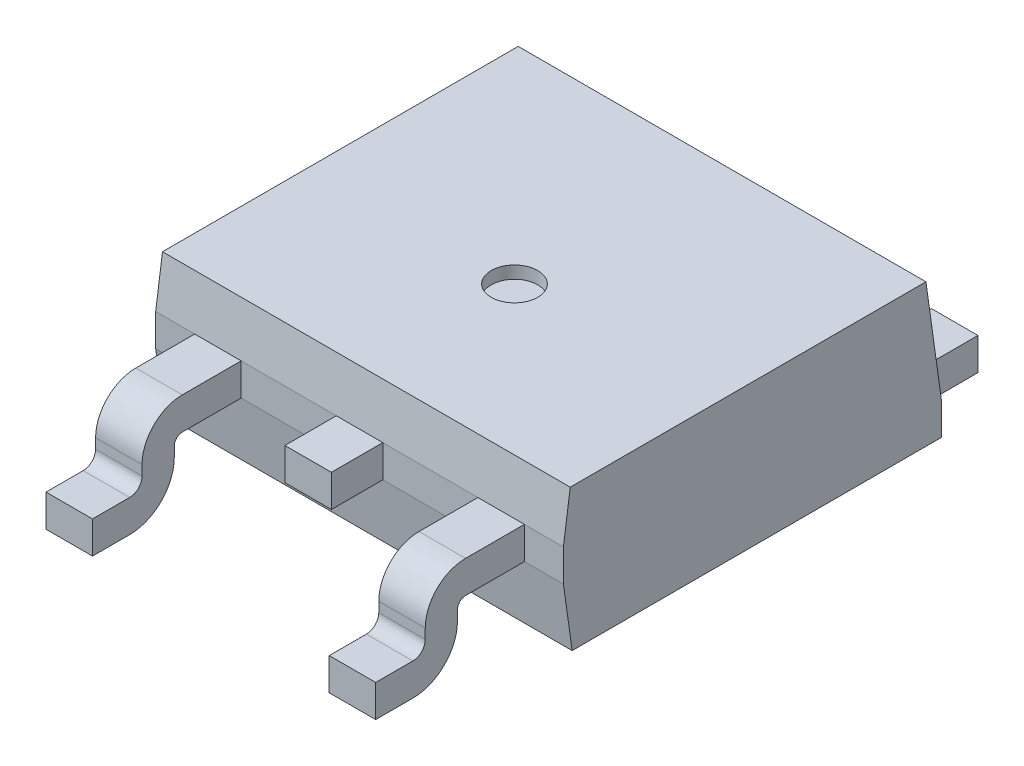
ISO-10303-21;
HEADER;
FILE_DESCRIPTION(('STEP AP214'),'2;1');
FILE_NAME('part.step','',(''),(''),'','','');
FILE_SCHEMA(('AUTOMOTIVE_DESIGN { 1 0 10303 214 1 1 1 1 }'));
ENDSEC;
DATA;
#1=APPLICATION_CONTEXT('core data for automotive mechanical design processes');
#2=APPLICATION_PROTOCOL_DEFINITION('international standard','automotive_design',2000,#1);
#3=PRODUCT_CONTEXT('',#1,'mechanical');
#4=PRODUCT('Part','Part','',(#3));
#5=PRODUCT_RELATED_PRODUCT_CATEGORY('part','',(#4));
#6=PRODUCT_DEFINITION_FORMATION('','',#4);
#7=PRODUCT_DEFINITION_CONTEXT('part definition',#1,'design');
#8=PRODUCT_DEFINITION('design','',#6,#7);
#9=PRODUCT_DEFINITION_SHAPE('','',#8);
#10=(LENGTH_UNIT() NAMED_UNIT(*) SI_UNIT(.MILLI.,.METRE.));
#11=(NAMED_UNIT(*) PLANE_ANGLE_UNIT() SI_UNIT($,.RADIAN.));
#12=(NAMED_UNIT(*) SI_UNIT($,.STERADIAN.) SOLID_ANGLE_UNIT());
#13=UNCERTAINTY_MEASURE_WITH_UNIT(LENGTH_MEASURE(1.E-05),#10,'distance_accuracy_value','');
#14=(GEOMETRIC_REPRESENTATION_CONTEXT(3) GLOBAL_UNCERTAINTY_ASSIGNED_CONTEXT((#13)) GLOBAL_UNIT_ASSIGNED_CONTEXT((#10,
#11,#12)) REPRESENTATION_CONTEXT('',''));
#15=CARTESIAN_POINT('',(0.,0.,0.));
#16=DIRECTION('',(0.,0.,1.));
#17=DIRECTION('',(1.,0.,0.));
#18=AXIS2_PLACEMENT_3D('',#15,#16,#17);
#19=CARTESIAN_POINT('',(5.97,0.,-1.78));
#20=DIRECTION('',(0.,-1.,0.));
#21=DIRECTION('',(0.,0.,-1.));
#22=AXIS2_PLACEMENT_3D('',#19,#20,#21);
#23=PLANE('',#22);
#24=DIRECTION('',(0.,0.,1.));
#25=VECTOR('',#24,1.);
#26=CARTESIAN_POINT('',(5.97,0.,-5.35));
#27=LINE('',#26,#25);
#28=CARTESIAN_POINT('',(5.97,0.,-5.35));
#29=VERTEX_POINT('',#28);
#30=CARTESIAN_POINT('',(5.97,0.,-1.78));
#31=VERTEX_POINT('',#30);
#32=EDGE_CURVE('E267',#29,#31,#27,.T.);
#33=ORIENTED_EDGE('',*,*,#32,.T.);
#34=DIRECTION('',(-1.,0.,0.));
#35=VECTOR('',#34,1.);
#36=CARTESIAN_POINT('',(5.97,0.,-1.78));
#37=LINE('',#36,#35);
#38=CARTESIAN_POINT('',(0.61,0.,-1.78));
#39=VERTEX_POINT('',#38);
#40=EDGE_CURVE('E270',#31,#39,#37,.T.);
#41=ORIENTED_EDGE('',*,*,#40,.T.);
#42=DIRECTION('',(0.,0.,-1.));
#43=VECTOR('',#42,1.);
#44=CARTESIAN_POINT('',(0.61,0.,-1.78));
#45=LINE('',#44,#43);
#46=CARTESIAN_POINT('',(0.61,0.,-5.35));
#47=VERTEX_POINT('',#46);
#48=EDGE_CURVE('E273',#39,#47,#45,.T.);
#49=ORIENTED_EDGE('',*,*,#48,.T.);
#50=DIRECTION('',(1.,0.,0.));
#51=VECTOR('',#50,1.);
#52=CARTESIAN_POINT('',(0.91,0.,-5.35));
#53=LINE('',#52,#51);
#54=CARTESIAN_POINT('',(0.91,0.,-5.35));
#55=VERTEX_POINT('',#54);
#56=EDGE_CURVE('E275',#47,#55,#53,.T.);
#57=ORIENTED_EDGE('',*,*,#56,.T.);
#58=DIRECTION('',(0.,0.,-1.));
#59=VECTOR('',#58,1.);
#60=CARTESIAN_POINT('',(0.91,0.,-5.7));
#61=LINE('',#60,#59);
#62=CARTESIAN_POINT('',(0.91,0.,-5.7));
#63=VERTEX_POINT('',#62);
#64=EDGE_CURVE('E277',#55,#63,#61,.T.);
#65=ORIENTED_EDGE('',*,*,#64,.T.);
#66=DIRECTION('',(-1.,0.,0.));
#67=VECTOR('',#66,1.);
#68=CARTESIAN_POINT('',(0.61,0.,-5.7));
#69=LINE('',#68,#67);
#70=CARTESIAN_POINT('',(0.61,0.,-5.7));
#71=VERTEX_POINT('',#70);
#72=EDGE_CURVE('E279',#63,#71,#69,.T.);
#73=ORIENTED_EDGE('',*,*,#72,.T.);
#74=DIRECTION('',(0.,0.,-1.));
#75=VECTOR('',#74,1.);
#76=CARTESIAN_POINT('',(0.61,0.,-5.7));
#77=LINE('',#76,#75);
#78=CARTESIAN_POINT('',(0.61,0.,-7.3));
#79=VERTEX_POINT('',#78);
#80=EDGE_CURVE('E281',#71,#79,#77,.T.);
#81=ORIENTED_EDGE('',*,*,#80,.T.);
#82=DIRECTION('',(1.,0.,0.));
#83=VECTOR('',#82,1.);
#84=CARTESIAN_POINT('',(0.61,0.,-7.3));
#85=LINE('',#84,#83);
#86=CARTESIAN_POINT('',(1.36,0.,-7.3));
#87=VERTEX_POINT('',#86);
#88=EDGE_CURVE('E283',#79,#87,#85,.T.);
#89=ORIENTED_EDGE('',*,*,#88,.T.);
#90=DIRECTION('',(0.,0.,1.));
#91=VECTOR('',#90,1.);
#92=CARTESIAN_POINT('',(1.36,0.,-7.3));
#93=LINE('',#92,#91);
#94=CARTESIAN_POINT('',(1.36,0.,-6.8));
#95=VERTEX_POINT('',#94);
#96=EDGE_CURVE('E285',#87,#95,#93,.T.);
#97=ORIENTED_EDGE('',*,*,#96,.T.);
#98=DIRECTION('',(1.,0.,0.));
#99=VECTOR('',#98,1.);
#100=CARTESIAN_POINT('',(1.36,0.,-6.8));
#101=LINE('',#100,#99);
#102=CARTESIAN_POINT('',(5.22,0.,-6.8));
#103=VERTEX_POINT('',#102);
#104=EDGE_CURVE('E287',#95,#103,#101,.T.);
#105=ORIENTED_EDGE('',*,*,#104,.T.);
#106=DIRECTION('',(0.,0.,-1.));
#107=VECTOR('',#106,1.);
#108=CARTESIAN_POINT('',(5.22,0.,-6.8));
#109=LINE('',#108,#107);
#110=CARTESIAN_POINT('',(5.22,0.,-7.3));
#111=VERTEX_POINT('',#110);
#112=EDGE_CURVE('E289',#103,#111,#109,.T.);
#113=ORIENTED_EDGE('',*,*,#112,.T.);
#114=DIRECTION('',(1.,0.,0.));
#115=VECTOR('',#114,1.);
#116=CARTESIAN_POINT('',(5.22,0.,-7.3));
#117=LINE('',#116,#115);
#118=CARTESIAN_POINT('',(5.97,0.,-7.3));
#119=VERTEX_POINT('',#118);
#120=EDGE_CURVE('E291',#111,#119,#117,.T.);
#121=ORIENTED_EDGE('',*,*,#120,.T.);
#122=DIRECTION('',(0.,0.,1.));
#123=VECTOR('',#122,1.);
#124=CARTESIAN_POINT('',(5.97,0.,-7.3));
#125=LINE('',#124,#123);
#126=CARTESIAN_POINT('',(5.97,0.,-5.7));
#127=VERTEX_POINT('',#126);
#128=EDGE_CURVE('E293',#119,#127,#125,.T.);
#129=ORIENTED_EDGE('',*,*,#128,.T.);
#130=DIRECTION('',(-1.,0.,0.));
#131=VECTOR('',#130,1.);
#132=CARTESIAN_POINT('',(5.97,0.,-5.7));
#133=LINE('',#132,#131);
#134=CARTESIAN_POINT('',(5.67,0.,-5.7));
#135=VERTEX_POINT('',#134);
#136=EDGE_CURVE('E295',#127,#135,#133,.T.);
#137=ORIENTED_EDGE('',*,*,#136,.T.);
#138=DIRECTION('',(0.,0.,1.));
#139=VECTOR('',#138,1.);
#140=CARTESIAN_POINT('',(5.67,0.,-5.7));
#141=LINE('',#140,#139);
#142=CARTESIAN_POINT('',(5.67,0.,-5.35));
#143=VERTEX_POINT('',#142);
#144=EDGE_CURVE('E297',#135,#143,#141,.T.);
#145=ORIENTED_EDGE('',*,*,#144,.T.);
#146=DIRECTION('',(1.,0.,0.));
#147=VECTOR('',#146,1.);
#148=CARTESIAN_POINT('',(5.67,0.,-5.35));
#149=LINE('',#148,#147);
#150=EDGE_CURVE('E299',#143,#29,#149,.T.);
#151=ORIENTED_EDGE('',*,*,#150,.T.);
#152=EDGE_LOOP('',(#33,#41,#49,#57,#65,#73,#81,#89,#97,#105,#113,#121,#129,#137,#145,#151));
#153=FACE_BOUND('',#152,.T.);
#154=DIRECTION('',(1.,0.,0.));
#155=VECTOR('',#154,1.);
#156=CARTESIAN_POINT('',(1.86,0.,-6.3));
#157=LINE('',#156,#155);
#158=CARTESIAN_POINT('',(1.86,0.,-6.3));
#159=VERTEX_POINT('',#158);
#160=CARTESIAN_POINT('',(4.72,0.,-6.3));
#161=VERTEX_POINT('',#160);
#162=EDGE_CURVE('E210',#159,#161,#157,.T.);
#163=ORIENTED_EDGE('',*,*,#162,.F.);
#164=CARTESIAN_POINT('',(1.86,0.,-6.05));
#165=DIRECTION('',(0.,-1.,0.));
#166=DIRECTION('',(0.,0.,-1.));
#167=AXIS2_PLACEMENT_3D('',#164,#165,#166);
#168=CIRCLE('',#167,0.25);
#169=CARTESIAN_POINT('',(1.61,0.,-6.05));
#170=VERTEX_POINT('',#169);
#171=EDGE_CURVE('E202',#170,#159,#168,.T.);
#172=ORIENTED_EDGE('',*,*,#171,.F.);
#173=DIRECTION('',(0.,0.,-1.));
#174=VECTOR('',#173,1.);
#175=CARTESIAN_POINT('',(1.61,0.,-5.95));
#176=LINE('',#175,#174);
#177=CARTESIAN_POINT('',(1.61,0.,-5.95));
#178=VERTEX_POINT('',#177);
#179=EDGE_CURVE('E235',#178,#170,#176,.T.);
#180=ORIENTED_EDGE('',*,*,#179,.F.);
#181=CARTESIAN_POINT('',(1.86,0.,-5.95));
#182=DIRECTION('',(0.,-1.,0.));
#183=DIRECTION('',(0.,0.,-1.));
#184=AXIS2_PLACEMENT_3D('',#181,#182,#183);
#185=CIRCLE('',#184,0.25);
#186=CARTESIAN_POINT('',(1.86,0.,-5.7));
#187=VERTEX_POINT('',#186);
#188=EDGE_CURVE('E233',#187,#178,#185,.T.);
#189=ORIENTED_EDGE('',*,*,#188,.F.);
#190=DIRECTION('',(-1.,0.,0.));
#191=VECTOR('',#190,1.);
#192=CARTESIAN_POINT('',(1.86,0.,-5.7));
#193=LINE('',#192,#191);
#194=CARTESIAN_POINT('',(4.72,0.,-5.7));
#195=VERTEX_POINT('',#194);
#196=EDGE_CURVE('E231',#195,#187,#193,.T.);
#197=ORIENTED_EDGE('',*,*,#196,.F.);
#198=CARTESIAN_POINT('',(4.72,0.,-5.95));
#199=DIRECTION('',(0.,-1.,0.));
#200=DIRECTION('',(0.,0.,-1.));
#201=AXIS2_PLACEMENT_3D('',#198,#199,#200);
#202=CIRCLE('',#201,0.25);
#203=CARTESIAN_POINT('',(4.97,0.,-5.95));
#204=VERTEX_POINT('',#203);
#205=EDGE_CURVE('E229',#204,#195,#202,.T.);
#206=ORIENTED_EDGE('',*,*,#205,.F.);
#207=DIRECTION('',(0.,0.,1.));
#208=VECTOR('',#207,1.);
#209=CARTESIAN_POINT('',(4.97,0.,-5.95));
#210=LINE('',#209,#208);
#211=CARTESIAN_POINT('',(4.97,0.,-6.05));
#212=VERTEX_POINT('',#211);
#213=EDGE_CURVE('E225',#212,#204,#210,.T.);
#214=ORIENTED_EDGE('',*,*,#213,.F.);
#215=CARTESIAN_POINT('',(4.72,0.,-6.05));
#216=DIRECTION('',(0.,-1.,0.));
#217=DIRECTION('',(0.,0.,-1.));
#218=AXIS2_PLACEMENT_3D('',#215,#216,#217);
#219=CIRCLE('',#218,0.25);
#220=EDGE_CURVE('E223',#161,#212,#219,.T.);
#221=ORIENTED_EDGE('',*,*,#220,.F.);
#222=EDGE_LOOP('',(#163,#172,#180,#189,#197,#206,#214,#221));
#223=FACE_BOUND('',#222,.T.);
#224=ADVANCED_FACE('F41',(#153,#223),#23,.T.);
#225=CARTESIAN_POINT('',(5.97,0.52,-1.78));
#226=DIRECTION('',(0.,-1.,0.));
#227=DIRECTION('',(0.,0.,-1.));
#228=AXIS2_PLACEMENT_3D('',#225,#226,#227);
#229=PLANE('',#228);
#230=DIRECTION('',(0.,0.,1.));
#231=VECTOR('',#230,1.);
#232=CARTESIAN_POINT('',(5.97,0.52,-5.35));
#233=LINE('',#232,#231);
#234=CARTESIAN_POINT('',(5.97,0.52,-5.35));
#235=VERTEX_POINT('',#234);
#236=CARTESIAN_POINT('',(5.97,0.52,-1.78));
#237=VERTEX_POINT('',#236);
#238=EDGE_CURVE('E218',#235,#237,#233,.T.);
#239=ORIENTED_EDGE('',*,*,#238,.F.);
#240=DIRECTION('',(1.,0.,0.));
#241=VECTOR('',#240,1.);
#242=CARTESIAN_POINT('',(5.67,0.52,-5.35));
#243=LINE('',#242,#241);
#244=CARTESIAN_POINT('',(5.67,0.52,-5.35));
#245=VERTEX_POINT('',#244);
#246=EDGE_CURVE('E271',#245,#235,#243,.T.);
#247=ORIENTED_EDGE('',*,*,#246,.F.);
#248=DIRECTION('',(0.,0.,1.));
#249=VECTOR('',#248,1.);
#250=CARTESIAN_POINT('',(5.67,0.52,-5.7));
#251=LINE('',#250,#249);
#252=CARTESIAN_POINT('',(5.67,0.52,-5.7));
#253=VERTEX_POINT('',#252);
#254=EDGE_CURVE('E330',#253,#245,#251,.T.);
#255=ORIENTED_EDGE('',*,*,#254,.F.);
#256=DIRECTION('',(-1.,0.,0.));
#257=VECTOR('',#256,1.);
#258=CARTESIAN_POINT('',(5.97,0.52,-5.7));
#259=LINE('',#258,#257);
#260=CARTESIAN_POINT('',(5.97,0.52,-5.7));
#261=VERTEX_POINT('',#260);
#262=EDGE_CURVE('E328',#261,#253,#259,.T.);
#263=ORIENTED_EDGE('',*,*,#262,.F.);
#264=DIRECTION('',(0.,0.,1.));
#265=VECTOR('',#264,1.);
#266=CARTESIAN_POINT('',(5.97,0.52,-7.3));
#267=LINE('',#266,#265);
#268=CARTESIAN_POINT('',(5.97,0.52,-7.3));
#269=VERTEX_POINT('',#268);
#270=EDGE_CURVE('E326',#269,#261,#267,.T.);
#271=ORIENTED_EDGE('',*,*,#270,.F.);
#272=DIRECTION('',(1.,0.,0.));
#273=VECTOR('',#272,1.);
#274=CARTESIAN_POINT('',(5.22,0.52,-7.3));
#275=LINE('',#274,#273);
#276=CARTESIAN_POINT('',(5.22,0.52,-7.3));
#277=VERTEX_POINT('',#276);
#278=EDGE_CURVE('E324',#277,#269,#275,.T.);
#279=ORIENTED_EDGE('',*,*,#278,.F.);
#280=DIRECTION('',(0.,0.,-1.));
#281=VECTOR('',#280,1.);
#282=CARTESIAN_POINT('',(5.22,0.52,-6.8));
#283=LINE('',#282,#281);
#284=CARTESIAN_POINT('',(5.22,0.52,-6.8));
#285=VERTEX_POINT('',#284);
#286=EDGE_CURVE('E322',#285,#277,#283,.T.);
#287=ORIENTED_EDGE('',*,*,#286,.F.);
#288=DIRECTION('',(1.,0.,0.));
#289=VECTOR('',#288,1.);
#290=CARTESIAN_POINT('',(1.36,0.52,-6.8));
#291=LINE('',#290,#289);
#292=CARTESIAN_POINT('',(1.36,0.52,-6.8));
#293=VERTEX_POINT('',#292);
#294=EDGE_CURVE('E320',#293,#285,#291,.T.);
#295=ORIENTED_EDGE('',*,*,#294,.F.);
#296=DIRECTION('',(0.,0.,1.));
#297=VECTOR('',#296,1.);
#298=CARTESIAN_POINT('',(1.36,0.52,-7.3));
#299=LINE('',#298,#297);
#300=CARTESIAN_POINT('',(1.36,0.52,-7.3));
#301=VERTEX_POINT('',#300);
#302=EDGE_CURVE('E318',#301,#293,#299,.T.);
#303=ORIENTED_EDGE('',*,*,#302,.F.);
#304=DIRECTION('',(1.,0.,0.));
#305=VECTOR('',#304,1.);
#306=CARTESIAN_POINT('',(0.61,0.52,-7.3));
#307=LINE('',#306,#305);
#308=CARTESIAN_POINT('',(0.61,0.52,-7.3));
#309=VERTEX_POINT('',#308);
#310=EDGE_CURVE('E316',#309,#301,#307,.T.);
#311=ORIENTED_EDGE('',*,*,#310,.F.);
#312=DIRECTION('',(0.,0.,-1.));
#313=VECTOR('',#312,1.);
#314=CARTESIAN_POINT('',(0.61,0.52,-5.7));
#315=LINE('',#314,#313);
#316=CARTESIAN_POINT('',(0.61,0.52,-5.7));
#317=VERTEX_POINT('',#316);
#318=EDGE_CURVE('E314',#317,#309,#315,.T.);
#319=ORIENTED_EDGE('',*,*,#318,.F.);
#320=DIRECTION('',(-1.,0.,0.));
#321=VECTOR('',#320,1.);
#322=CARTESIAN_POINT('',(0.61,0.52,-5.7));
#323=LINE('',#322,#321);
#324=CARTESIAN_POINT('',(0.91,0.52,-5.7));
#325=VERTEX_POINT('',#324);
#326=EDGE_CURVE('E312',#325,#317,#323,.T.);
#327=ORIENTED_EDGE('',*,*,#326,.F.);
#328=DIRECTION('',(0.,0.,-1.));
#329=VECTOR('',#328,1.);
#330=CARTESIAN_POINT('',(0.91,0.52,-5.7));
#331=LINE('',#330,#329);
#332=CARTESIAN_POINT('',(0.91,0.52,-5.35));
#333=VERTEX_POINT('',#332);
#334=EDGE_CURVE('E310',#333,#325,#331,.T.);
#335=ORIENTED_EDGE('',*,*,#334,.F.);
#336=DIRECTION('',(1.,0.,0.));
#337=VECTOR('',#336,1.);
#338=CARTESIAN_POINT('',(0.91,0.52,-5.35));
#339=LINE('',#338,#337);
#340=CARTESIAN_POINT('',(0.61,0.52,-5.35));
#341=VERTEX_POINT('',#340);
#342=EDGE_CURVE('E308',#341,#333,#339,.T.);
#343=ORIENTED_EDGE('',*,*,#342,.F.);
#344=DIRECTION('',(0.,0.,-1.));
#345=VECTOR('',#344,1.);
#346=CARTESIAN_POINT('',(0.61,0.52,-1.78));
#347=LINE('',#346,#345);
#348=CARTESIAN_POINT('',(0.61,0.52,-1.78));
#349=VERTEX_POINT('',#348);
#350=EDGE_CURVE('E306',#349,#341,#347,.T.);
#351=ORIENTED_EDGE('',*,*,#350,.F.);
#352=DIRECTION('',(-1.,0.,0.));
#353=VECTOR('',#352,1.);
#354=CARTESIAN_POINT('',(5.97,0.52,-1.78));
#355=LINE('',#354,#353);
#356=EDGE_CURVE('E304',#237,#349,#355,.T.);
#357=ORIENTED_EDGE('',*,*,#356,.F.);
#358=EDGE_LOOP('',(#239,#247,#255,#263,#271,#279,#287,#295,#303,#311,#319,#327,#335,#343,#351,#357));
#359=FACE_BOUND('',#358,.T.);
#360=CARTESIAN_POINT('',(1.86,0.52,-6.05));
#361=DIRECTION('',(0.,-1.,0.));
#362=DIRECTION('',(0.,0.,-1.));
#363=AXIS2_PLACEMENT_3D('',#360,#361,#362);
#364=CIRCLE('',#363,0.25);
#365=CARTESIAN_POINT('',(1.61,0.52,-6.05));
#366=VERTEX_POINT('',#365);
#367=CARTESIAN_POINT('',(1.86,0.52,-6.3));
#368=VERTEX_POINT('',#367);
#369=EDGE_CURVE('E64',#366,#368,#364,.T.);
#370=ORIENTED_EDGE('',*,*,#369,.T.);
#371=DIRECTION('',(1.,0.,0.));
#372=VECTOR('',#371,1.);
#373=CARTESIAN_POINT('',(1.86,0.52,-6.3));
#374=LINE('',#373,#372);
#375=CARTESIAN_POINT('',(4.72,0.52,-6.3));
#376=VERTEX_POINT('',#375);
#377=EDGE_CURVE('E217',#368,#376,#374,.T.);
#378=ORIENTED_EDGE('',*,*,#377,.T.);
#379=CARTESIAN_POINT('',(4.72,0.52,-6.05));
#380=DIRECTION('',(0.,-1.,0.));
#381=DIRECTION('',(0.,0.,-1.));
#382=AXIS2_PLACEMENT_3D('',#379,#380,#381);
#383=CIRCLE('',#382,0.25);
#384=CARTESIAN_POINT('',(4.97,0.52,-6.05));
#385=VERTEX_POINT('',#384);
#386=EDGE_CURVE('E239',#376,#385,#383,.T.);
#387=ORIENTED_EDGE('',*,*,#386,.T.);
#388=DIRECTION('',(0.,0.,1.));
#389=VECTOR('',#388,1.);
#390=CARTESIAN_POINT('',(4.97,0.52,-5.95));
#391=LINE('',#390,#389);
#392=CARTESIAN_POINT('',(4.97,0.52,-5.95));
#393=VERTEX_POINT('',#392);
#394=EDGE_CURVE('E242',#385,#393,#391,.T.);
#395=ORIENTED_EDGE('',*,*,#394,.T.);
#396=CARTESIAN_POINT('',(4.72,0.52,-5.95));
#397=DIRECTION('',(0.,-1.,0.));
#398=DIRECTION('',(0.,0.,-1.));
#399=AXIS2_PLACEMENT_3D('',#396,#397,#398);
#400=CIRCLE('',#399,0.25);
#401=CARTESIAN_POINT('',(4.72,0.52,-5.7));
#402=VERTEX_POINT('',#401);
#403=EDGE_CURVE('E245',#393,#402,#400,.T.);
#404=ORIENTED_EDGE('',*,*,#403,.T.);
#405=DIRECTION('',(-1.,0.,0.));
#406=VECTOR('',#405,1.);
#407=CARTESIAN_POINT('',(1.86,0.52,-5.7));
#408=LINE('',#407,#406);
#409=CARTESIAN_POINT('',(1.86,0.52,-5.7));
#410=VERTEX_POINT('',#409);
#411=EDGE_CURVE('E248',#402,#410,#408,.T.);
#412=ORIENTED_EDGE('',*,*,#411,.T.);
#413=CARTESIAN_POINT('',(1.86,0.52,-5.95));
#414=DIRECTION('',(0.,-1.,0.));
#415=DIRECTION('',(0.,0.,-1.));
#416=AXIS2_PLACEMENT_3D('',#413,#414,#415);
#417=CIRCLE('',#416,0.25);
#418=CARTESIAN_POINT('',(1.61,0.52,-5.95));
#419=VERTEX_POINT('',#418);
#420=EDGE_CURVE('E251',#410,#419,#417,.T.);
#421=ORIENTED_EDGE('',*,*,#420,.T.);
#422=DIRECTION('',(0.,0.,-1.));
#423=VECTOR('',#422,1.);
#424=CARTESIAN_POINT('',(1.61,0.52,-5.95));
#425=LINE('',#424,#423);
#426=EDGE_CURVE('E211',#419,#366,#425,.T.);
#427=ORIENTED_EDGE('',*,*,#426,.T.);
#428=EDGE_LOOP('',(#370,#378,#387,#395,#404,#412,#421,#427));
#429=FACE_BOUND('',#428,.T.);
#430=ADVANCED_FACE('F384',(#359,#429),#229,.F.);
#431=CARTESIAN_POINT('',(5.97,0.,-5.35));
#432=DIRECTION('',(-1.,0.,0.));
#433=DIRECTION('',(0.,0.,1.));
#434=AXIS2_PLACEMENT_3D('',#431,#432,#433);
#435=PLANE('',#434);
#436=ORIENTED_EDGE('',*,*,#238,.T.);
#437=DIRECTION('',(0.,1.,0.));
#438=VECTOR('',#437,1.);
#439=CARTESIAN_POINT('',(5.97,0.,-1.78));
#440=LINE('',#439,#438);
#441=EDGE_CURVE('E12',#31,#237,#440,.T.);
#442=ORIENTED_EDGE('',*,*,#441,.F.);
#443=ORIENTED_EDGE('',*,*,#32,.F.);
#444=DIRECTION('',(0.,1.,0.));
#445=VECTOR('',#444,1.);
#446=CARTESIAN_POINT('',(5.97,0.,-5.35));
#447=LINE('',#446,#445);
#448=EDGE_CURVE('E301',#29,#235,#447,.T.);
#449=ORIENTED_EDGE('',*,*,#448,.T.);
#450=EDGE_LOOP('',(#436,#442,#443,#449));
#451=FACE_BOUND('',#450,.T.);
#452=ADVANCED_FACE('F43',(#451),#435,.F.);
#453=CARTESIAN_POINT('',(5.97,0.,-1.78));
#454=DIRECTION('',(0.,0.,-1.));
#455=DIRECTION('',(0.,1.,0.));
#456=AXIS2_PLACEMENT_3D('',#453,#454,#455);
#457=PLANE('',#456);
#458=ORIENTED_EDGE('',*,*,#356,.T.);
#459=DIRECTION('',(0.,1.,0.));
#460=VECTOR('',#459,1.);
#461=CARTESIAN_POINT('',(0.61,0.,-1.78));
#462=LINE('',#461,#460);
#463=EDGE_CURVE('E49',#39,#349,#462,.T.);
#464=ORIENTED_EDGE('',*,*,#463,.F.);
#465=ORIENTED_EDGE('',*,*,#40,.F.);
#466=ORIENTED_EDGE('',*,*,#441,.T.);
#467=EDGE_LOOP('',(#458,#464,#465,#466));
#468=FACE_BOUND('',#467,.T.);
#469=ADVANCED_FACE('F401',(#468),#457,.F.);
#470=CARTESIAN_POINT('',(0.61,0.,-1.78));
#471=DIRECTION('',(1.,0.,0.));
#472=DIRECTION('',(0.,0.,-1.));
#473=AXIS2_PLACEMENT_3D('',#470,#471,#472);
#474=PLANE('',#473);
#475=ORIENTED_EDGE('',*,*,#350,.T.);
#476=DIRECTION('',(0.,1.,0.));
#477=VECTOR('',#476,1.);
#478=CARTESIAN_POINT('',(0.61,0.,-5.35));
#479=LINE('',#478,#477);
#480=EDGE_CURVE('E371',#47,#341,#479,.T.);
#481=ORIENTED_EDGE('',*,*,#480,.F.);
#482=ORIENTED_EDGE('',*,*,#48,.F.);
#483=ORIENTED_EDGE('',*,*,#463,.T.);
#484=EDGE_LOOP('',(#475,#481,#482,#483));
#485=FACE_BOUND('',#484,.T.);
#486=ADVANCED_FACE('F378',(#485),#474,.F.);
#487=CARTESIAN_POINT('',(0.91,0.,-5.35));
#488=DIRECTION('',(0.,0.,1.));
#489=DIRECTION('',(0.,-1.,0.));
#490=AXIS2_PLACEMENT_3D('',#487,#488,#489);
#491=PLANE('',#490);
#492=ORIENTED_EDGE('',*,*,#342,.T.);
#493=DIRECTION('',(0.,1.,0.));
#494=VECTOR('',#493,1.);
#495=CARTESIAN_POINT('',(0.91,0.,-5.35));
#496=LINE('',#495,#494);
#497=EDGE_CURVE('E368',#55,#333,#496,.T.);
#498=ORIENTED_EDGE('',*,*,#497,.F.);
#499=ORIENTED_EDGE('',*,*,#56,.F.);
#500=ORIENTED_EDGE('',*,*,#480,.T.);
#501=EDGE_LOOP('',(#492,#498,#499,#500));
#502=FACE_BOUND('',#501,.T.);
#503=ADVANCED_FACE('F390',(#502),#491,.F.);
#504=CARTESIAN_POINT('',(0.91,0.,-5.7));
#505=DIRECTION('',(1.,0.,0.));
#506=DIRECTION('',(0.,0.,-1.));
#507=AXIS2_PLACEMENT_3D('',#504,#505,#506);
#508=PLANE('',#507);
#509=ORIENTED_EDGE('',*,*,#334,.T.);
#510=DIRECTION('',(0.,1.,0.));
#511=VECTOR('',#510,1.);
#512=CARTESIAN_POINT('',(0.91,0.,-5.7));
#513=LINE('',#512,#511);
#514=EDGE_CURVE('E365',#63,#325,#513,.T.);
#515=ORIENTED_EDGE('',*,*,#514,.F.);
#516=ORIENTED_EDGE('',*,*,#64,.F.);
#517=ORIENTED_EDGE('',*,*,#497,.T.);
#518=EDGE_LOOP('',(#509,#515,#516,#517));
#519=FACE_BOUND('',#518,.T.);
#520=ADVANCED_FACE('F394',(#519),#508,.F.);
#521=CARTESIAN_POINT('',(0.61,0.,-5.7));
#522=DIRECTION('',(0.,0.,-1.));
#523=DIRECTION('',(0.,1.,0.));
#524=AXIS2_PLACEMENT_3D('',#521,#522,#523);
#525=PLANE('',#524);
#526=ORIENTED_EDGE('',*,*,#326,.T.);
#527=DIRECTION('',(0.,1.,0.));
#528=VECTOR('',#527,1.);
#529=CARTESIAN_POINT('',(0.61,0.,-5.7));
#530=LINE('',#529,#528);
#531=EDGE_CURVE('E362',#71,#317,#530,.T.);
#532=ORIENTED_EDGE('',*,*,#531,.F.);
#533=ORIENTED_EDGE('',*,*,#72,.F.);
#534=ORIENTED_EDGE('',*,*,#514,.T.);
#535=EDGE_LOOP('',(#526,#532,#533,#534));
#536=FACE_BOUND('',#535,.T.);
#537=ADVANCED_FACE('F454',(#536),#525,.F.);
#538=CARTESIAN_POINT('',(0.61,0.,-5.7));
#539=DIRECTION('',(1.,0.,0.));
#540=DIRECTION('',(0.,0.,-1.));
#541=AXIS2_PLACEMENT_3D('',#538,#539,#540);
#542=PLANE('',#541);
#543=ORIENTED_EDGE('',*,*,#318,.T.);
#544=DIRECTION('',(0.,1.,0.));
#545=VECTOR('',#544,1.);
#546=CARTESIAN_POINT('',(0.61,0.,-7.3));
#547=LINE('',#546,#545);
#548=EDGE_CURVE('E359',#79,#309,#547,.T.);
#549=ORIENTED_EDGE('',*,*,#548,.F.);
#550=ORIENTED_EDGE('',*,*,#80,.F.);
#551=ORIENTED_EDGE('',*,*,#531,.T.);
#552=EDGE_LOOP('',(#543,#549,#550,#551));
#553=FACE_BOUND('',#552,.T.);
#554=ADVANCED_FACE('F451',(#553),#542,.F.);
#555=CARTESIAN_POINT('',(0.61,0.,-7.3));
#556=DIRECTION('',(0.,0.,1.));
#557=DIRECTION('',(0.,-1.,0.));
#558=AXIS2_PLACEMENT_3D('',#555,#556,#557);
#559=PLANE('',#558);
#560=ORIENTED_EDGE('',*,*,#310,.T.);
#561=DIRECTION('',(0.,1.,0.));
#562=VECTOR('',#561,1.);
#563=CARTESIAN_POINT('',(1.36,0.,-7.3));
#564=LINE('',#563,#562);
#565=EDGE_CURVE('E356',#87,#301,#564,.T.);
#566=ORIENTED_EDGE('',*,*,#565,.F.);
#567=ORIENTED_EDGE('',*,*,#88,.F.);
#568=ORIENTED_EDGE('',*,*,#548,.T.);
#569=EDGE_LOOP('',(#560,#566,#567,#568));
#570=FACE_BOUND('',#569,.T.);
#571=ADVANCED_FACE('F447',(#570),#559,.F.);
#572=CARTESIAN_POINT('',(1.36,0.,-7.3));
#573=DIRECTION('',(-1.,0.,0.));
#574=DIRECTION('',(0.,0.,1.));
#575=AXIS2_PLACEMENT_3D('',#572,#573,#574);
#576=PLANE('',#575);
#577=ORIENTED_EDGE('',*,*,#302,.T.);
#578=DIRECTION('',(0.,1.,0.));
#579=VECTOR('',#578,1.);
#580=CARTESIAN_POINT('',(1.36,0.,-6.8));
#581=LINE('',#580,#579);
#582=EDGE_CURVE('E353',#95,#293,#581,.T.);
#583=ORIENTED_EDGE('',*,*,#582,.F.);
#584=ORIENTED_EDGE('',*,*,#96,.F.);
#585=ORIENTED_EDGE('',*,*,#565,.T.);
#586=EDGE_LOOP('',(#577,#583,#584,#585));
#587=FACE_BOUND('',#586,.T.);
#588=ADVANCED_FACE('F443',(#587),#576,.F.);
#589=CARTESIAN_POINT('',(1.36,0.,-6.8));
#590=DIRECTION('',(0.,0.,1.));
#591=DIRECTION('',(0.,-1.,0.));
#592=AXIS2_PLACEMENT_3D('',#589,#590,#591);
#593=PLANE('',#592);
#594=ORIENTED_EDGE('',*,*,#294,.T.);
#595=DIRECTION('',(0.,1.,0.));
#596=VECTOR('',#595,1.);
#597=CARTESIAN_POINT('',(5.22,0.,-6.8));
#598=LINE('',#597,#596);
#599=EDGE_CURVE('E350',#103,#285,#598,.T.);
#600=ORIENTED_EDGE('',*,*,#599,.F.);
#601=ORIENTED_EDGE('',*,*,#104,.F.);
#602=ORIENTED_EDGE('',*,*,#582,.T.);
#603=EDGE_LOOP('',(#594,#600,#601,#602));
#604=FACE_BOUND('',#603,.T.);
#605=ADVANCED_FACE('F438',(#604),#593,.F.);
#606=CARTESIAN_POINT('',(5.22,0.,-6.8));
#607=DIRECTION('',(1.,0.,0.));
#608=DIRECTION('',(0.,0.,-1.));
#609=AXIS2_PLACEMENT_3D('',#606,#607,#608);
#610=PLANE('',#609);
#611=ORIENTED_EDGE('',*,*,#286,.T.);
#612=DIRECTION('',(0.,1.,0.));
#613=VECTOR('',#612,1.);
#614=CARTESIAN_POINT('',(5.22,0.,-7.3));
#615=LINE('',#614,#613);
#616=EDGE_CURVE('E347',#111,#277,#615,.T.);
#617=ORIENTED_EDGE('',*,*,#616,.F.);
#618=ORIENTED_EDGE('',*,*,#112,.F.);
#619=ORIENTED_EDGE('',*,*,#599,.T.);
#620=EDGE_LOOP('',(#611,#617,#618,#619));
#621=FACE_BOUND('',#620,.T.);
#622=ADVANCED_FACE('F432',(#621),#610,.F.);
#623=CARTESIAN_POINT('',(5.22,0.,-7.3));
#624=DIRECTION('',(0.,0.,1.));
#625=DIRECTION('',(0.,-1.,0.));
#626=AXIS2_PLACEMENT_3D('',#623,#624,#625);
#627=PLANE('',#626);
#628=ORIENTED_EDGE('',*,*,#278,.T.);
#629=DIRECTION('',(0.,1.,0.));
#630=VECTOR('',#629,1.);
#631=CARTESIAN_POINT('',(5.97,0.,-7.3));
#632=LINE('',#631,#630);
#633=EDGE_CURVE('E344',#119,#269,#632,.T.);
#634=ORIENTED_EDGE('',*,*,#633,.F.);
#635=ORIENTED_EDGE('',*,*,#120,.F.);
#636=ORIENTED_EDGE('',*,*,#616,.T.);
#637=EDGE_LOOP('',(#628,#634,#635,#636));
#638=FACE_BOUND('',#637,.T.);
#639=ADVANCED_FACE('F428',(#638),#627,.F.);
#640=CARTESIAN_POINT('',(5.97,0.,-7.3));
#641=DIRECTION('',(-1.,0.,0.));
#642=DIRECTION('',(0.,0.,1.));
#643=AXIS2_PLACEMENT_3D('',#640,#641,#642);
#644=PLANE('',#643);
#645=ORIENTED_EDGE('',*,*,#270,.T.);
#646=DIRECTION('',(0.,1.,0.));
#647=VECTOR('',#646,1.);
#648=CARTESIAN_POINT('',(5.97,0.,-5.7));
#649=LINE('',#648,#647);
#650=EDGE_CURVE('E341',#127,#261,#649,.T.);
#651=ORIENTED_EDGE('',*,*,#650,.F.);
#652=ORIENTED_EDGE('',*,*,#128,.F.);
#653=ORIENTED_EDGE('',*,*,#633,.T.);
#654=EDGE_LOOP('',(#645,#651,#652,#653));
#655=FACE_BOUND('',#654,.T.);
#656=ADVANCED_FACE('F423',(#655),#644,.F.);
#657=CARTESIAN_POINT('',(5.97,0.,-5.7));
#658=DIRECTION('',(0.,0.,-1.));
#659=DIRECTION('',(0.,1.,0.));
#660=AXIS2_PLACEMENT_3D('',#657,#658,#659);
#661=PLANE('',#660);
#662=ORIENTED_EDGE('',*,*,#262,.T.);
#663=DIRECTION('',(0.,1.,0.));
#664=VECTOR('',#663,1.);
#665=CARTESIAN_POINT('',(5.67,0.,-5.7));
#666=LINE('',#665,#664);
#667=EDGE_CURVE('E338',#135,#253,#666,.T.);
#668=ORIENTED_EDGE('',*,*,#667,.F.);
#669=ORIENTED_EDGE('',*,*,#136,.F.);
#670=ORIENTED_EDGE('',*,*,#650,.T.);
#671=EDGE_LOOP('',(#662,#668,#669,#670));
#672=FACE_BOUND('',#671,.T.);
#673=ADVANCED_FACE('F417',(#672),#661,.F.);
#674=CARTESIAN_POINT('',(5.67,0.,-5.7));
#675=DIRECTION('',(-1.,0.,0.));
#676=DIRECTION('',(0.,0.,1.));
#677=AXIS2_PLACEMENT_3D('',#674,#675,#676);
#678=PLANE('',#677);
#679=ORIENTED_EDGE('',*,*,#254,.T.);
#680=DIRECTION('',(0.,1.,0.));
#681=VECTOR('',#680,1.);
#682=CARTESIAN_POINT('',(5.67,0.,-5.35));
#683=LINE('',#682,#681);
#684=EDGE_CURVE('E335',#143,#245,#683,.T.);
#685=ORIENTED_EDGE('',*,*,#684,.F.);
#686=ORIENTED_EDGE('',*,*,#144,.F.);
#687=ORIENTED_EDGE('',*,*,#667,.T.);
#688=EDGE_LOOP('',(#679,#685,#686,#687));
#689=FACE_BOUND('',#688,.T.);
#690=ADVANCED_FACE('F413',(#689),#678,.F.);
#691=CARTESIAN_POINT('',(5.67,0.,-5.35));
#692=DIRECTION('',(0.,0.,1.));
#693=DIRECTION('',(0.,-1.,0.));
#694=AXIS2_PLACEMENT_3D('',#691,#692,#693);
#695=PLANE('',#694);
#696=ORIENTED_EDGE('',*,*,#246,.T.);
#697=ORIENTED_EDGE('',*,*,#448,.F.);
#698=ORIENTED_EDGE('',*,*,#150,.F.);
#699=ORIENTED_EDGE('',*,*,#684,.T.);
#700=EDGE_LOOP('',(#696,#697,#698,#699));
#701=FACE_BOUND('',#700,.T.);
#702=ADVANCED_FACE('F408',(#701),#695,.F.);
#703=CARTESIAN_POINT('',(1.86,0.,-6.05));
#704=DIRECTION('',(0.,1.,0.));
#705=DIRECTION('',(0.,0.,1.));
#706=AXIS2_PLACEMENT_3D('',#703,#704,#705);
#707=CYLINDRICAL_SURFACE('',#706,0.25);
#708=ORIENTED_EDGE('',*,*,#369,.F.);
#709=DIRECTION('',(0.,1.,0.));
#710=VECTOR('',#709,1.);
#711=CARTESIAN_POINT('',(1.61,0.,-6.05));
#712=LINE('',#711,#710);
#713=EDGE_CURVE('E206',#170,#366,#712,.T.);
#714=ORIENTED_EDGE('',*,*,#713,.F.);
#715=ORIENTED_EDGE('',*,*,#171,.T.);
#716=DIRECTION('',(0.,1.,0.));
#717=VECTOR('',#716,1.);
#718=CARTESIAN_POINT('',(1.86,0.,-6.3));
#719=LINE('',#718,#717);
#720=EDGE_CURVE('E205',#159,#368,#719,.T.);
#721=ORIENTED_EDGE('',*,*,#720,.T.);
#722=EDGE_LOOP('',(#708,#714,#715,#721));
#723=FACE_BOUND('',#722,.T.);
#724=ADVANCED_FACE('F204',(#723),#707,.F.);
#725=CARTESIAN_POINT('',(1.86,0.,-6.3));
#726=DIRECTION('',(0.,0.,1.));
#727=DIRECTION('',(0.,-1.,0.));
#728=AXIS2_PLACEMENT_3D('',#725,#726,#727);
#729=PLANE('',#728);
#730=ORIENTED_EDGE('',*,*,#377,.F.);
#731=ORIENTED_EDGE('',*,*,#720,.F.);
#732=ORIENTED_EDGE('',*,*,#162,.T.);
#733=DIRECTION('',(0.,1.,0.));
#734=VECTOR('',#733,1.);
#735=CARTESIAN_POINT('',(4.72,0.,-6.3));
#736=LINE('',#735,#734);
#737=EDGE_CURVE('E219',#161,#376,#736,.T.);
#738=ORIENTED_EDGE('',*,*,#737,.T.);
#739=EDGE_LOOP('',(#730,#731,#732,#738));
#740=FACE_BOUND('',#739,.T.);
#741=ADVANCED_FACE('F214',(#740),#729,.T.);
#742=CARTESIAN_POINT('',(4.72,0.,-6.05));
#743=DIRECTION('',(0.,1.,0.));
#744=DIRECTION('',(0.,0.,1.));
#745=AXIS2_PLACEMENT_3D('',#742,#743,#744);
#746=CYLINDRICAL_SURFACE('',#745,0.25);
#747=ORIENTED_EDGE('',*,*,#386,.F.);
#748=ORIENTED_EDGE('',*,*,#737,.F.);
#749=ORIENTED_EDGE('',*,*,#220,.T.);
#750=DIRECTION('',(0.,1.,0.));
#751=VECTOR('',#750,1.);
#752=CARTESIAN_POINT('',(4.97,0.,-6.05));
#753=LINE('',#752,#751);
#754=EDGE_CURVE('E264',#212,#385,#753,.T.);
#755=ORIENTED_EDGE('',*,*,#754,.T.);
#756=EDGE_LOOP('',(#747,#748,#749,#755));
#757=FACE_BOUND('',#756,.T.);
#758=ADVANCED_FACE('F536',(#757),#746,.F.);
#759=CARTESIAN_POINT('',(4.97,0.,-5.95));
#760=DIRECTION('',(-1.,0.,0.));
#761=DIRECTION('',(0.,0.,1.));
#762=AXIS2_PLACEMENT_3D('',#759,#760,#761);
#763=PLANE('',#762);
#764=ORIENTED_EDGE('',*,*,#394,.F.);
#765=ORIENTED_EDGE('',*,*,#754,.F.);
#766=ORIENTED_EDGE('',*,*,#213,.T.);
#767=DIRECTION('',(0.,1.,0.));
#768=VECTOR('',#767,1.);
#769=CARTESIAN_POINT('',(4.97,0.,-5.95));
#770=LINE('',#769,#768);
#771=EDGE_CURVE('E262',#204,#393,#770,.T.);
#772=ORIENTED_EDGE('',*,*,#771,.T.);
#773=EDGE_LOOP('',(#764,#765,#766,#772));
#774=FACE_BOUND('',#773,.T.);
#775=ADVANCED_FACE('F542',(#774),#763,.T.);
#776=CARTESIAN_POINT('',(4.72,0.,-5.95));
#777=DIRECTION('',(0.,1.,0.));
#778=DIRECTION('',(0.,0.,1.));
#779=AXIS2_PLACEMENT_3D('',#776,#777,#778);
#780=CYLINDRICAL_SURFACE('',#779,0.25);
#781=ORIENTED_EDGE('',*,*,#403,.F.);
#782=ORIENTED_EDGE('',*,*,#771,.F.);
#783=ORIENTED_EDGE('',*,*,#205,.T.);
#784=DIRECTION('',(0.,1.,0.));
#785=VECTOR('',#784,1.);
#786=CARTESIAN_POINT('',(4.72,0.,-5.7));
#787=LINE('',#786,#785);
#788=EDGE_CURVE('E260',#195,#402,#787,.T.);
#789=ORIENTED_EDGE('',*,*,#788,.T.);
#790=EDGE_LOOP('',(#781,#782,#783,#789));
#791=FACE_BOUND('',#790,.T.);
#792=ADVANCED_FACE('F550',(#791),#780,.F.);
#793=CARTESIAN_POINT('',(1.86,0.,-5.7));
#794=DIRECTION('',(0.,0.,-1.));
#795=DIRECTION('',(0.,1.,0.));
#796=AXIS2_PLACEMENT_3D('',#793,#794,#795);
#797=PLANE('',#796);
#798=ORIENTED_EDGE('',*,*,#411,.F.);
#799=ORIENTED_EDGE('',*,*,#788,.F.);
#800=ORIENTED_EDGE('',*,*,#196,.T.);
#801=DIRECTION('',(0.,1.,0.));
#802=VECTOR('',#801,1.);
#803=CARTESIAN_POINT('',(1.86,0.,-5.7));
#804=LINE('',#803,#802);
#805=EDGE_CURVE('E258',#187,#410,#804,.T.);
#806=ORIENTED_EDGE('',*,*,#805,.T.);
#807=EDGE_LOOP('',(#798,#799,#800,#806));
#808=FACE_BOUND('',#807,.T.);
#809=ADVANCED_FACE('F558',(#808),#797,.T.);
#810=CARTESIAN_POINT('',(1.86,0.,-5.95));
#811=DIRECTION('',(0.,1.,0.));
#812=DIRECTION('',(0.,0.,1.));
#813=AXIS2_PLACEMENT_3D('',#810,#811,#812);
#814=CYLINDRICAL_SURFACE('',#813,0.25);
#815=ORIENTED_EDGE('',*,*,#420,.F.);
#816=ORIENTED_EDGE('',*,*,#805,.F.);
#817=ORIENTED_EDGE('',*,*,#188,.T.);
#818=DIRECTION('',(0.,1.,0.));
#819=VECTOR('',#818,1.);
#820=CARTESIAN_POINT('',(1.61,0.,-5.95));
#821=LINE('',#820,#819);
#822=EDGE_CURVE('E56',#178,#419,#821,.T.);
#823=ORIENTED_EDGE('',*,*,#822,.T.);
#824=EDGE_LOOP('',(#815,#816,#817,#823));
#825=FACE_BOUND('',#824,.T.);
#826=ADVANCED_FACE('F566',(#825),#814,.F.);
#827=CARTESIAN_POINT('',(1.61,0.,-5.95));
#828=DIRECTION('',(1.,0.,0.));
#829=DIRECTION('',(0.,0.,-1.));
#830=AXIS2_PLACEMENT_3D('',#827,#828,#829);
#831=PLANE('',#830);
#832=ORIENTED_EDGE('',*,*,#426,.F.);
#833=ORIENTED_EDGE('',*,*,#822,.F.);
#834=ORIENTED_EDGE('',*,*,#179,.T.);
#835=ORIENTED_EDGE('',*,*,#713,.T.);
#836=EDGE_LOOP('',(#832,#833,#834,#835));
#837=FACE_BOUND('',#836,.T.);
#838=ADVANCED_FACE('F574',(#837),#831,.T.);
#839=CLOSED_SHELL('',(#224,#430,#452,#469,#486,#503,#520,#537,#554,#571,#588,#605,#622,#639,
#656,#673,#690,#702,#724,#741,#758,#775,#792,#809,#826,#838));
#840=MANIFOLD_SOLID_BREP('B2',#839);
#841=CARTESIAN_POINT('',(6.58,1.,0.));
#842=DIRECTION('',(0.,0.,-1.));
#843=DIRECTION('',(-1.,0.,0.));
#844=AXIS2_PLACEMENT_3D('',#841,#842,#843);
#845=PLANE('',#844);
#846=DIRECTION('',(0.,1.,0.));
#847=VECTOR('',#846,1.);
#848=CARTESIAN_POINT('',(3.665,1.52,0.));
#849=LINE('',#848,#847);
#850=CARTESIAN_POINT('',(3.665,1.,0.));
#851=VERTEX_POINT('',#850);
#852=CARTESIAN_POINT('',(3.665,1.52,0.));
#853=VERTEX_POINT('',#852);
#854=EDGE_CURVE('E965',#851,#853,#849,.T.);
#855=ORIENTED_EDGE('',*,*,#854,.F.);
#856=DIRECTION('',(-1.,0.,0.));
#857=VECTOR('',#856,1.);
#858=CARTESIAN_POINT('',(6.58,1.,0.));
#859=LINE('',#858,#857);
#860=CARTESIAN_POINT('',(5.2,1.,0.));
#861=VERTEX_POINT('',#860);
#862=EDGE_CURVE('E1098',#861,#851,#859,.T.);
#863=ORIENTED_EDGE('',*,*,#862,.F.);
#864=DIRECTION('',(0.,-1.,0.));
#865=VECTOR('',#864,1.);
#866=CARTESIAN_POINT('',(5.2,1.52,0.));
#867=LINE('',#866,#865);
#868=CARTESIAN_POINT('',(5.2,1.52,0.));
#869=VERTEX_POINT('',#868);
#870=EDGE_CURVE('E970',#869,#861,#867,.T.);
#871=ORIENTED_EDGE('',*,*,#870,.F.);
#872=DIRECTION('',(-1.,0.,0.));
#873=VECTOR('',#872,1.);
#874=CARTESIAN_POINT('',(6.58,1.52,0.));
#875=LINE('',#874,#873);
#876=EDGE_CURVE('E1104',#869,#853,#875,.T.);
#877=ORIENTED_EDGE('',*,*,#876,.T.);
#878=EDGE_LOOP('',(#855,#863,#871,#877));
#879=FACE_BOUND('',#878,.T.);
#880=ADVANCED_FACE('F687',(#879),#845,.F.);
#881=DIRECTION('',(0.,-1.,0.));
#882=VECTOR('',#881,1.);
#883=CARTESIAN_POINT('',(2.915,1.52,0.));
#884=LINE('',#883,#882);
#885=CARTESIAN_POINT('',(2.915,1.52,0.));
#886=VERTEX_POINT('',#885);
#887=CARTESIAN_POINT('',(2.915,1.,0.));
#888=VERTEX_POINT('',#887);
#889=EDGE_CURVE('E1404',#886,#888,#884,.T.);
#890=ORIENTED_EDGE('',*,*,#889,.F.);
#891=CARTESIAN_POINT('',(1.38,1.52,0.));
#892=VERTEX_POINT('',#891);
#893=EDGE_CURVE('E691',#886,#892,#875,.T.);
#894=ORIENTED_EDGE('',*,*,#893,.T.);
#895=DIRECTION('',(0.,1.,0.));
#896=VECTOR('',#895,1.);
#897=CARTESIAN_POINT('',(1.38,1.52,0.));
#898=LINE('',#897,#896);
#899=CARTESIAN_POINT('',(1.38,1.,0.));
#900=VERTEX_POINT('',#899);
#901=EDGE_CURVE('E1139',#900,#892,#898,.T.);
#902=ORIENTED_EDGE('',*,*,#901,.F.);
#903=EDGE_CURVE('E1103',#888,#900,#859,.T.);
#904=ORIENTED_EDGE('',*,*,#903,.F.);
#905=EDGE_LOOP('',(#890,#894,#902,#904));
#906=FACE_BOUND('',#905,.T.);
#907=ADVANCED_FACE('F1360',(#906),#845,.F.);
#908=DIRECTION('',(0.,1.,0.));
#909=VECTOR('',#908,1.);
#910=CARTESIAN_POINT('',(5.95,1.52,0.));
#911=LINE('',#910,#909);
#912=CARTESIAN_POINT('',(5.95,1.,0.));
#913=VERTEX_POINT('',#912);
#914=CARTESIAN_POINT('',(5.95,1.52,0.));
#915=VERTEX_POINT('',#914);
#916=EDGE_CURVE('E979',#913,#915,#911,.T.);
#917=ORIENTED_EDGE('',*,*,#916,.F.);
#918=CARTESIAN_POINT('',(6.58,1.,0.));
#919=VERTEX_POINT('',#918);
#920=EDGE_CURVE('E1102',#919,#913,#859,.T.);
#921=ORIENTED_EDGE('',*,*,#920,.F.);
#922=DIRECTION('',(0.,-1.,0.));
#923=VECTOR('',#922,1.);
#924=CARTESIAN_POINT('',(6.58,1.,0.));
#925=LINE('',#924,#923);
#926=CARTESIAN_POINT('',(6.58,1.52,0.));
#927=VERTEX_POINT('',#926);
#928=EDGE_CURVE('E1283',#927,#919,#925,.T.);
#929=ORIENTED_EDGE('',*,*,#928,.F.);
#930=EDGE_CURVE('E1125',#927,#915,#875,.T.);
#931=ORIENTED_EDGE('',*,*,#930,.T.);
#932=EDGE_LOOP('',(#917,#921,#929,#931));
#933=FACE_BOUND('',#932,.T.);
#934=ADVANCED_FACE('F1367',(#933),#845,.F.);
#935=DIRECTION('',(0.,-1.,0.));
#936=VECTOR('',#935,1.);
#937=CARTESIAN_POINT('',(0.629999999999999,1.52,0.));
#938=LINE('',#937,#936);
#939=CARTESIAN_POINT('',(0.630000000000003,1.52,0.));
#940=VERTEX_POINT('',#939);
#941=CARTESIAN_POINT('',(0.630000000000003,1.,0.));
#942=VERTEX_POINT('',#941);
#943=EDGE_CURVE('E1073',#940,#942,#938,.T.);
#944=ORIENTED_EDGE('',*,*,#943,.F.);
#945=CARTESIAN_POINT('',(0.,1.52,0.));
#946=VERTEX_POINT('',#945);
#947=EDGE_CURVE('E1119',#940,#946,#875,.T.);
#948=ORIENTED_EDGE('',*,*,#947,.T.);
#949=DIRECTION('',(0.,-1.,0.));
#950=VECTOR('',#949,1.);
#951=CARTESIAN_POINT('',(0.,1.,0.));
#952=LINE('',#951,#950);
#953=CARTESIAN_POINT('',(0.,1.,0.));
#954=VERTEX_POINT('',#953);
#955=EDGE_CURVE('E1298',#946,#954,#952,.T.);
#956=ORIENTED_EDGE('',*,*,#955,.T.);
#957=EDGE_CURVE('E1114',#942,#954,#859,.T.);
#958=ORIENTED_EDGE('',*,*,#957,.F.);
#959=EDGE_LOOP('',(#944,#948,#956,#958));
#960=FACE_BOUND('',#959,.T.);
#961=ADVANCED_FACE('F1363',(#960),#845,.F.);
#962=CARTESIAN_POINT('',(6.58,0.,-6.1));
#963=DIRECTION('',(0.,0.,1.));
#964=DIRECTION('',(1.,0.,0.));
#965=AXIS2_PLACEMENT_3D('',#962,#963,#964);
#966=PLANE('',#965);
#967=DIRECTION('',(-1.,0.,0.));
#968=VECTOR('',#967,1.);
#969=CARTESIAN_POINT('',(6.58,0.52,-6.1));
#970=LINE('',#969,#968);
#971=CARTESIAN_POINT('',(0.61,0.52,-6.1));
#972=VERTEX_POINT('',#971);
#973=CARTESIAN_POINT('',(0.,0.52,-6.1));
#974=VERTEX_POINT('',#973);
#975=EDGE_CURVE('E697',#972,#974,#970,.T.);
#976=ORIENTED_EDGE('',*,*,#975,.F.);
#977=DIRECTION('',(0.,-1.,0.));
#978=VECTOR('',#977,1.);
#979=CARTESIAN_POINT('',(0.61,0.52,-6.1));
#980=LINE('',#979,#978);
#981=CARTESIAN_POINT('',(0.61,0.,-6.1));
#982=VERTEX_POINT('',#981);
#983=EDGE_CURVE('E1257',#972,#982,#980,.T.);
#984=ORIENTED_EDGE('',*,*,#983,.T.);
#985=DIRECTION('',(-1.,0.,0.));
#986=VECTOR('',#985,1.);
#987=CARTESIAN_POINT('',(6.58,0.,-6.1));
#988=LINE('',#987,#986);
#989=CARTESIAN_POINT('',(0.,0.,-6.1));
#990=VERTEX_POINT('',#989);
#991=EDGE_CURVE('E1289',#982,#990,#988,.T.);
#992=ORIENTED_EDGE('',*,*,#991,.T.);
#993=DIRECTION('',(0.,1.,0.));
#994=VECTOR('',#993,1.);
#995=CARTESIAN_POINT('',(0.,0.,-6.1));
#996=LINE('',#995,#994);
#997=EDGE_CURVE('E1266',#990,#974,#996,.T.);
#998=ORIENTED_EDGE('',*,*,#997,.T.);
#999=EDGE_LOOP('',(#976,#984,#992,#998));
#1000=FACE_BOUND('',#999,.T.);
#1001=ADVANCED_FACE('F1314',(#1000),#966,.F.);
#1002=CARTESIAN_POINT('',(6.58,0.,-6.1));
#1003=VERTEX_POINT('',#1002);
#1004=CARTESIAN_POINT('',(5.97,0.,-6.1));
#1005=VERTEX_POINT('',#1004);
#1006=EDGE_CURVE('E1304',#1003,#1005,#988,.T.);
#1007=ORIENTED_EDGE('',*,*,#1006,.T.);
#1008=DIRECTION('',(0.,-1.,0.));
#1009=VECTOR('',#1008,1.);
#1010=CARTESIAN_POINT('',(5.97,0.52,-6.1));
#1011=LINE('',#1010,#1009);
#1012=CARTESIAN_POINT('',(5.97,0.52,-6.1));
#1013=VERTEX_POINT('',#1012);
#1014=EDGE_CURVE('E1269',#1013,#1005,#1011,.T.);
#1015=ORIENTED_EDGE('',*,*,#1014,.F.);
#1016=CARTESIAN_POINT('',(6.58,0.52,-6.1));
#1017=VERTEX_POINT('',#1016);
#1018=EDGE_CURVE('E39',#1017,#1013,#970,.T.);
#1019=ORIENTED_EDGE('',*,*,#1018,.F.);
#1020=DIRECTION('',(0.,1.,0.));
#1021=VECTOR('',#1020,1.);
#1022=CARTESIAN_POINT('',(6.58,0.,-6.1));
#1023=LINE('',#1022,#1021);
#1024=EDGE_CURVE('E1273',#1003,#1017,#1023,.T.);
#1025=ORIENTED_EDGE('',*,*,#1024,.F.);
#1026=EDGE_LOOP('',(#1007,#1015,#1019,#1025));
#1027=FACE_BOUND('',#1026,.T.);
#1028=ADVANCED_FACE('F689',(#1027),#966,.F.);
#1029=CARTESIAN_POINT('',(6.58,0.52,-6.1));
#1030=DIRECTION('',(0.,-0.139173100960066,0.99026806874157));
#1031=DIRECTION('',(0.,-0.99026806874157,-0.139173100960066));
#1032=AXIS2_PLACEMENT_3D('',#1029,#1030,#1031);
#1033=PLANE('',#1032);
#1034=DIRECTION('',(0.,0.99026806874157,0.139173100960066));
#1035=VECTOR('',#1034,1.);
#1036=CARTESIAN_POINT('',(0.,0.52,-6.1));
#1037=LINE('',#1036,#1035);
#1038=CARTESIAN_POINT('',(0.,2.3,-5.84983731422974));
#1039=VERTEX_POINT('',#1038);
#1040=EDGE_CURVE('E1292',#974,#1039,#1037,.T.);
#1041=ORIENTED_EDGE('',*,*,#1040,.T.);
#1042=DIRECTION('',(-1.,0.,0.));
#1043=VECTOR('',#1042,1.);
#1044=CARTESIAN_POINT('',(6.58,2.3,-5.84983731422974));
#1045=LINE('',#1044,#1043);
#1046=CARTESIAN_POINT('',(6.58,2.3,-5.84983731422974));
#1047=VERTEX_POINT('',#1046);
#1048=EDGE_CURVE('E1121',#1047,#1039,#1045,.T.);
#1049=ORIENTED_EDGE('',*,*,#1048,.F.);
#1050=DIRECTION('',(0.,0.99026806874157,0.139173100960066));
#1051=VECTOR('',#1050,1.);
#1052=CARTESIAN_POINT('',(6.58,0.52,-6.1));
#1053=LINE('',#1052,#1051);
#1054=EDGE_CURVE('E1276',#1017,#1047,#1053,.T.);
#1055=ORIENTED_EDGE('',*,*,#1054,.F.);
#1056=ORIENTED_EDGE('',*,*,#1018,.T.);
#1057=DIRECTION('',(1.,0.,0.));
#1058=VECTOR('',#1057,1.);
#1059=CARTESIAN_POINT('',(0.61,0.52,-6.1));
#1060=LINE('',#1059,#1058);
#1061=EDGE_CURVE('E1247',#972,#1013,#1060,.T.);
#1062=ORIENTED_EDGE('',*,*,#1061,.F.);
#1063=ORIENTED_EDGE('',*,*,#975,.T.);
#1064=EDGE_LOOP('',(#1041,#1049,#1055,#1056,#1062,#1063));
#1065=FACE_BOUND('',#1064,.T.);
#1066=ADVANCED_FACE('F1329',(#1065),#1033,.F.);
#1067=CARTESIAN_POINT('',(6.58,2.3,-0.109621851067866));
#1068=DIRECTION('',(0.,-1.,0.));
#1069=DIRECTION('',(0.,0.,-1.));
#1070=AXIS2_PLACEMENT_3D('',#1067,#1068,#1069);
#1071=PLANE('',#1070);
#1072=CARTESIAN_POINT('',(3.29,2.3,-2.5));
#1073=DIRECTION('',(0.,1.,0.));
#1074=DIRECTION('',(0.,0.,1.));
#1075=AXIS2_PLACEMENT_3D('',#1072,#1073,#1074);
#1076=CIRCLE('',#1075,0.375);
#1077=CARTESIAN_POINT('',(3.29,2.3,-2.125));
#1078=VERTEX_POINT('',#1077);
#1079=EDGE_CURVE('E1701',#1078,#1078,#1076,.T.);
#1080=ORIENTED_EDGE('',*,*,#1079,.F.);
#1081=EDGE_LOOP('',(#1080));
#1082=FACE_BOUND('',#1081,.T.);
#1083=DIRECTION('',(0.,0.,1.));
#1084=VECTOR('',#1083,1.);
#1085=CARTESIAN_POINT('',(0.,2.3,-0.109621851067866));
#1086=LINE('',#1085,#1084);
#1087=CARTESIAN_POINT('',(0.,2.3,-0.109621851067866));
#1088=VERTEX_POINT('',#1087);
#1089=EDGE_CURVE('E1294',#1039,#1088,#1086,.T.);
#1090=ORIENTED_EDGE('',*,*,#1089,.T.);
#1091=DIRECTION('',(-1.,0.,0.));
#1092=VECTOR('',#1091,1.);
#1093=CARTESIAN_POINT('',(6.58,2.3,-0.109621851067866));
#1094=LINE('',#1093,#1092);
#1095=CARTESIAN_POINT('',(6.58,2.3,-0.109621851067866));
#1096=VERTEX_POINT('',#1095);
#1097=EDGE_CURVE('E1123',#1096,#1088,#1094,.T.);
#1098=ORIENTED_EDGE('',*,*,#1097,.F.);
#1099=DIRECTION('',(0.,0.,1.));
#1100=VECTOR('',#1099,1.);
#1101=CARTESIAN_POINT('',(6.58,2.3,-0.109621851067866));
#1102=LINE('',#1101,#1100);
#1103=EDGE_CURVE('E1279',#1047,#1096,#1102,.T.);
#1104=ORIENTED_EDGE('',*,*,#1103,.F.);
#1105=ORIENTED_EDGE('',*,*,#1048,.T.);
#1106=EDGE_LOOP('',(#1090,#1098,#1104,#1105));
#1107=FACE_BOUND('',#1106,.T.);
#1108=ADVANCED_FACE('F1333',(#1082,#1107),#1071,.F.);
#1109=CARTESIAN_POINT('',(6.58,1.52,0.));
#1110=DIRECTION('',(0.,-0.139173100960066,-0.99026806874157));
#1111=DIRECTION('',(0.,0.99026806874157,-0.139173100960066));
#1112=AXIS2_PLACEMENT_3D('',#1109,#1110,#1111);
#1113=PLANE('',#1112);
#1114=DIRECTION('',(0.,-0.99026806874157,0.139173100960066));
#1115=VECTOR('',#1114,1.);
#1116=CARTESIAN_POINT('',(0.,1.52,0.));
#1117=LINE('',#1116,#1115);
#1118=EDGE_CURVE('E1296',#1088,#946,#1117,.T.);
#1119=ORIENTED_EDGE('',*,*,#1118,.T.);
#1120=ORIENTED_EDGE('',*,*,#947,.F.);
#1121=DIRECTION('',(-1.,0.,0.));
#1122=VECTOR('',#1121,1.);
#1123=CARTESIAN_POINT('',(0.629999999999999,1.52,0.));
#1124=LINE('',#1123,#1122);
#1125=EDGE_CURVE('E1078',#892,#940,#1124,.T.);
#1126=ORIENTED_EDGE('',*,*,#1125,.F.);
#1127=ORIENTED_EDGE('',*,*,#893,.F.);
#1128=DIRECTION('',(-1.,0.,0.));
#1129=VECTOR('',#1128,1.);
#1130=CARTESIAN_POINT('',(2.915,1.52,0.));
#1131=LINE('',#1130,#1129);
#1132=EDGE_CURVE('E1406',#853,#886,#1131,.T.);
#1133=ORIENTED_EDGE('',*,*,#1132,.F.);
#1134=ORIENTED_EDGE('',*,*,#876,.F.);
#1135=DIRECTION('',(-1.,0.,0.));
#1136=VECTOR('',#1135,1.);
#1137=CARTESIAN_POINT('',(5.95,1.52,0.));
#1138=LINE('',#1137,#1136);
#1139=EDGE_CURVE('E967',#915,#869,#1138,.T.);
#1140=ORIENTED_EDGE('',*,*,#1139,.F.);
#1141=ORIENTED_EDGE('',*,*,#930,.F.);
#1142=DIRECTION('',(0.,-0.99026806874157,0.139173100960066));
#1143=VECTOR('',#1142,1.);
#1144=CARTESIAN_POINT('',(6.58,1.52,0.));
#1145=LINE('',#1144,#1143);
#1146=EDGE_CURVE('E1281',#1096,#927,#1145,.T.);
#1147=ORIENTED_EDGE('',*,*,#1146,.F.);
#1148=ORIENTED_EDGE('',*,*,#1097,.T.);
#1149=EDGE_LOOP('',(#1119,#1120,#1126,#1127,#1133,#1134,#1140,#1141,#1147,#1148));
#1150=FACE_BOUND('',#1149,.T.);
#1151=ADVANCED_FACE('F1381',(#1150),#1113,.F.);
#1152=CARTESIAN_POINT('',(6.58,1.,0.));
#1153=DIRECTION('',(0.,0.139173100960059,-0.990268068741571));
#1154=DIRECTION('',(0.,0.990268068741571,0.139173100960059));
#1155=AXIS2_PLACEMENT_3D('',#1152,#1153,#1154);
#1156=PLANE('',#1155);
#1157=DIRECTION('',(0.,-0.990268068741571,-0.139173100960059));
#1158=VECTOR('',#1157,1.);
#1159=CARTESIAN_POINT('',(0.,1.,0.));
#1160=LINE('',#1159,#1158);
#1161=CARTESIAN_POINT('',(0.,0.,-0.140540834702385));
#1162=VERTEX_POINT('',#1161);
#1163=EDGE_CURVE('E1301',#954,#1162,#1160,.T.);
#1164=ORIENTED_EDGE('',*,*,#1163,.T.);
#1165=DIRECTION('',(-1.,0.,0.));
#1166=VECTOR('',#1165,1.);
#1167=CARTESIAN_POINT('',(6.58,0.,-0.140540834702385));
#1168=LINE('',#1167,#1166);
#1169=CARTESIAN_POINT('',(6.58,0.,-0.140540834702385));
#1170=VERTEX_POINT('',#1169);
#1171=EDGE_CURVE('E1107',#1170,#1162,#1168,.T.);
#1172=ORIENTED_EDGE('',*,*,#1171,.F.);
#1173=DIRECTION('',(0.,-0.990268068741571,-0.139173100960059));
#1174=VECTOR('',#1173,1.);
#1175=CARTESIAN_POINT('',(6.58,1.,0.));
#1176=LINE('',#1175,#1174);
#1177=EDGE_CURVE('E1285',#919,#1170,#1176,.T.);
#1178=ORIENTED_EDGE('',*,*,#1177,.F.);
#1179=ORIENTED_EDGE('',*,*,#920,.T.);
#1180=DIRECTION('',(1.,0.,0.));
#1181=VECTOR('',#1180,1.);
#1182=CARTESIAN_POINT('',(5.95,1.,0.));
#1183=LINE('',#1182,#1181);
#1184=EDGE_CURVE('E984',#861,#913,#1183,.T.);
#1185=ORIENTED_EDGE('',*,*,#1184,.F.);
#1186=ORIENTED_EDGE('',*,*,#862,.T.);
#1187=DIRECTION('',(1.,0.,0.));
#1188=VECTOR('',#1187,1.);
#1189=CARTESIAN_POINT('',(2.915,1.,0.));
#1190=LINE('',#1189,#1188);
#1191=EDGE_CURVE('E961',#888,#851,#1190,.T.);
#1192=ORIENTED_EDGE('',*,*,#1191,.F.);
#1193=ORIENTED_EDGE('',*,*,#903,.T.);
#1194=DIRECTION('',(1.,0.,0.));
#1195=VECTOR('',#1194,1.);
#1196=CARTESIAN_POINT('',(0.63,1.,0.));
#1197=LINE('',#1196,#1195);
#1198=EDGE_CURVE('E1090',#942,#900,#1197,.T.);
#1199=ORIENTED_EDGE('',*,*,#1198,.F.);
#1200=ORIENTED_EDGE('',*,*,#957,.T.);
#1201=EDGE_LOOP('',(#1164,#1172,#1178,#1179,#1185,#1186,#1192,#1193,#1199,#1200));
#1202=FACE_BOUND('',#1201,.T.);
#1203=ADVANCED_FACE('F1401',(#1202),#1156,.F.);
#1204=CARTESIAN_POINT('',(6.58,0.,-0.140540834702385));
#1205=DIRECTION('',(0.,1.,0.));
#1206=DIRECTION('',(0.,0.,1.));
#1207=AXIS2_PLACEMENT_3D('',#1204,#1205,#1206);
#1208=PLANE('',#1207);
#1209=ORIENTED_EDGE('',*,*,#991,.F.);
#1210=DIRECTION('',(0.,0.,-1.));
#1211=VECTOR('',#1210,1.);
#1212=CARTESIAN_POINT('',(0.61,0.,-6.1));
#1213=LINE('',#1212,#1211);
#1214=CARTESIAN_POINT('',(0.61,0.,-1.78));
#1215=VERTEX_POINT('',#1214);
#1216=EDGE_CURVE('E1243',#1215,#982,#1213,.T.);
#1217=ORIENTED_EDGE('',*,*,#1216,.F.);
#1218=DIRECTION('',(-1.,0.,0.));
#1219=VECTOR('',#1218,1.);
#1220=CARTESIAN_POINT('',(0.61,0.,-1.78));
#1221=LINE('',#1220,#1219);
#1222=CARTESIAN_POINT('',(5.97,0.,-1.78));
#1223=VERTEX_POINT('',#1222);
#1224=EDGE_CURVE('E1248',#1223,#1215,#1221,.T.);
#1225=ORIENTED_EDGE('',*,*,#1224,.F.);
#1226=DIRECTION('',(0.,0.,1.));
#1227=VECTOR('',#1226,1.);
#1228=CARTESIAN_POINT('',(5.97,0.,-6.1));
#1229=LINE('',#1228,#1227);
#1230=EDGE_CURVE('E1259',#1005,#1223,#1229,.T.);
#1231=ORIENTED_EDGE('',*,*,#1230,.F.);
#1232=ORIENTED_EDGE('',*,*,#1006,.F.);
#1233=DIRECTION('',(0.,0.,-1.));
#1234=VECTOR('',#1233,1.);
#1235=CARTESIAN_POINT('',(6.58,0.,-0.140540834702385));
#1236=LINE('',#1235,#1234);
#1237=EDGE_CURVE('E1287',#1170,#1003,#1236,.T.);
#1238=ORIENTED_EDGE('',*,*,#1237,.F.);
#1239=ORIENTED_EDGE('',*,*,#1171,.T.);
#1240=DIRECTION('',(0.,0.,-1.));
#1241=VECTOR('',#1240,1.);
#1242=CARTESIAN_POINT('',(0.,0.,-0.140540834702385));
#1243=LINE('',#1242,#1241);
#1244=EDGE_CURVE('E1277',#1162,#990,#1243,.T.);
#1245=ORIENTED_EDGE('',*,*,#1244,.T.);
#1246=EDGE_LOOP('',(#1209,#1217,#1225,#1231,#1232,#1238,#1239,#1245));
#1247=FACE_BOUND('',#1246,.T.);
#1248=ADVANCED_FACE('F1319',(#1247),#1208,.F.);
#1249=CARTESIAN_POINT('',(6.58,2.3,-6.1));
#1250=DIRECTION('',(-1.,0.,0.));
#1251=DIRECTION('',(0.,0.,1.));
#1252=AXIS2_PLACEMENT_3D('',#1249,#1250,#1251);
#1253=PLANE('',#1252);
#1254=ORIENTED_EDGE('',*,*,#1024,.T.);
#1255=ORIENTED_EDGE('',*,*,#1054,.T.);
#1256=ORIENTED_EDGE('',*,*,#1103,.T.);
#1257=ORIENTED_EDGE('',*,*,#1146,.T.);
#1258=ORIENTED_EDGE('',*,*,#928,.T.);
#1259=ORIENTED_EDGE('',*,*,#1177,.T.);
#1260=ORIENTED_EDGE('',*,*,#1237,.T.);
#1261=EDGE_LOOP('',(#1254,#1255,#1256,#1257,#1258,#1259,#1260));
#1262=FACE_BOUND('',#1261,.T.);
#1263=ADVANCED_FACE('F1335',(#1262),#1253,.F.);
#1264=CARTESIAN_POINT('',(0.,2.3,-6.1));
#1265=DIRECTION('',(-1.,0.,0.));
#1266=DIRECTION('',(0.,0.,1.));
#1267=AXIS2_PLACEMENT_3D('',#1264,#1265,#1266);
#1268=PLANE('',#1267);
#1269=ORIENTED_EDGE('',*,*,#997,.F.);
#1270=ORIENTED_EDGE('',*,*,#1244,.F.);
#1271=ORIENTED_EDGE('',*,*,#1163,.F.);
#1272=ORIENTED_EDGE('',*,*,#955,.F.);
#1273=ORIENTED_EDGE('',*,*,#1118,.F.);
#1274=ORIENTED_EDGE('',*,*,#1089,.F.);
#1275=ORIENTED_EDGE('',*,*,#1040,.F.);
#1276=EDGE_LOOP('',(#1269,#1270,#1271,#1272,#1273,#1274,#1275));
#1277=FACE_BOUND('',#1276,.T.);
#1278=ADVANCED_FACE('F1325',(#1277),#1268,.T.);
#1279=CARTESIAN_POINT('',(0.61,0.52,-6.1));
#1280=DIRECTION('',(-1.,0.,0.));
#1281=DIRECTION('',(0.,0.,1.));
#1282=AXIS2_PLACEMENT_3D('',#1279,#1280,#1281);
#1283=PLANE('',#1282);
#1284=ORIENTED_EDGE('',*,*,#1216,.T.);
#1285=ORIENTED_EDGE('',*,*,#983,.F.);
#1286=DIRECTION('',(0.,0.,-1.));
#1287=VECTOR('',#1286,1.);
#1288=CARTESIAN_POINT('',(0.61,0.52,-6.1));
#1289=LINE('',#1288,#1287);
#1290=CARTESIAN_POINT('',(0.61,0.52,-1.78));
#1291=VERTEX_POINT('',#1290);
#1292=EDGE_CURVE('E1244',#1291,#972,#1289,.T.);
#1293=ORIENTED_EDGE('',*,*,#1292,.F.);
#1294=DIRECTION('',(0.,-1.,0.));
#1295=VECTOR('',#1294,1.);
#1296=CARTESIAN_POINT('',(0.61,0.52,-1.78));
#1297=LINE('',#1296,#1295);
#1298=EDGE_CURVE('E1264',#1291,#1215,#1297,.T.);
#1299=ORIENTED_EDGE('',*,*,#1298,.T.);
#1300=EDGE_LOOP('',(#1284,#1285,#1293,#1299));
#1301=FACE_BOUND('',#1300,.T.);
#1302=ADVANCED_FACE('F1348',(#1301),#1283,.F.);
#1303=CARTESIAN_POINT('',(0.61,0.52,-1.78));
#1304=DIRECTION('',(0.,0.,1.));
#1305=DIRECTION('',(0.,-1.,0.));
#1306=AXIS2_PLACEMENT_3D('',#1303,#1304,#1305);
#1307=PLANE('',#1306);
#1308=ORIENTED_EDGE('',*,*,#1224,.T.);
#1309=ORIENTED_EDGE('',*,*,#1298,.F.);
#1310=DIRECTION('',(-1.,0.,0.));
#1311=VECTOR('',#1310,1.);
#1312=CARTESIAN_POINT('',(0.61,0.52,-1.78));
#1313=LINE('',#1312,#1311);
#1314=CARTESIAN_POINT('',(5.97,0.52,-1.78));
#1315=VERTEX_POINT('',#1314);
#1316=EDGE_CURVE('E1254',#1315,#1291,#1313,.T.);
#1317=ORIENTED_EDGE('',*,*,#1316,.F.);
#1318=DIRECTION('',(0.,-1.,0.));
#1319=VECTOR('',#1318,1.);
#1320=CARTESIAN_POINT('',(5.97,0.52,-1.78));
#1321=LINE('',#1320,#1319);
#1322=EDGE_CURVE('E1267',#1315,#1223,#1321,.T.);
#1323=ORIENTED_EDGE('',*,*,#1322,.T.);
#1324=EDGE_LOOP('',(#1308,#1309,#1317,#1323));
#1325=FACE_BOUND('',#1324,.T.);
#1326=ADVANCED_FACE('F1342',(#1325),#1307,.F.);
#1327=CARTESIAN_POINT('',(5.97,0.52,-6.1));
#1328=DIRECTION('',(1.,0.,0.));
#1329=DIRECTION('',(0.,0.,-1.));
#1330=AXIS2_PLACEMENT_3D('',#1327,#1328,#1329);
#1331=PLANE('',#1330);
#1332=ORIENTED_EDGE('',*,*,#1230,.T.);
#1333=ORIENTED_EDGE('',*,*,#1322,.F.);
#1334=DIRECTION('',(0.,0.,1.));
#1335=VECTOR('',#1334,1.);
#1336=CARTESIAN_POINT('',(5.97,0.52,-6.1));
#1337=LINE('',#1336,#1335);
#1338=EDGE_CURVE('E1251',#1013,#1315,#1337,.T.);
#1339=ORIENTED_EDGE('',*,*,#1338,.F.);
#1340=ORIENTED_EDGE('',*,*,#1014,.T.);
#1341=EDGE_LOOP('',(#1332,#1333,#1339,#1340));
#1342=FACE_BOUND('',#1341,.T.);
#1343=ADVANCED_FACE('F1339',(#1342),#1331,.F.);
#1344=CARTESIAN_POINT('',(0.61,0.52,-1.78));
#1345=DIRECTION('',(0.,1.,0.));
#1346=DIRECTION('',(0.,0.,1.));
#1347=AXIS2_PLACEMENT_3D('',#1344,#1345,#1346);
#1348=PLANE('',#1347);
#1349=ORIENTED_EDGE('',*,*,#1292,.T.);
#1350=ORIENTED_EDGE('',*,*,#1061,.T.);
#1351=ORIENTED_EDGE('',*,*,#1338,.T.);
#1352=ORIENTED_EDGE('',*,*,#1316,.T.);
#1353=EDGE_LOOP('',(#1349,#1350,#1351,#1352));
#1354=FACE_BOUND('',#1353,.T.);
#1355=ADVANCED_FACE('F1346',(#1354),#1348,.F.);
#1356=CARTESIAN_POINT('',(0.63,-0.00900000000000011,1.8));
#1357=DIRECTION('',(0.,-1.,0.));
#1358=DIRECTION('',(0.,0.,-1.));
#1359=AXIS2_PLACEMENT_3D('',#1356,#1357,#1358);
#1360=PLANE('',#1359);
#1361=DIRECTION('',(1.,0.,0.));
#1362=VECTOR('',#1361,1.);
#1363=CARTESIAN_POINT('',(0.63,-0.00900000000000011,1.8));
#1364=LINE('',#1363,#1362);
#1365=CARTESIAN_POINT('',(0.63,-0.00900000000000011,1.8));
#1366=VERTEX_POINT('',#1365);
#1367=CARTESIAN_POINT('',(1.38,-0.00900000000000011,1.8));
#1368=VERTEX_POINT('',#1367);
#1369=EDGE_CURVE('E1204',#1366,#1368,#1364,.T.);
#1370=ORIENTED_EDGE('',*,*,#1369,.T.);
#1371=DIRECTION('',(0.,0.,1.));
#1372=VECTOR('',#1371,1.);
#1373=CARTESIAN_POINT('',(1.38,-0.00900000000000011,1.8));
#1374=LINE('',#1373,#1372);
#1375=CARTESIAN_POINT('',(1.38,-0.00900000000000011,2.4));
#1376=VERTEX_POINT('',#1375);
#1377=EDGE_CURVE('E1237',#1368,#1376,#1374,.T.);
#1378=ORIENTED_EDGE('',*,*,#1377,.T.);
#1379=DIRECTION('',(1.,0.,0.));
#1380=VECTOR('',#1379,1.);
#1381=CARTESIAN_POINT('',(0.63,-0.00900000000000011,2.4));
#1382=LINE('',#1381,#1380);
#1383=CARTESIAN_POINT('',(0.63,-0.00900000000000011,2.4));
#1384=VERTEX_POINT('',#1383);
#1385=EDGE_CURVE('E1228',#1384,#1376,#1382,.T.);
#1386=ORIENTED_EDGE('',*,*,#1385,.F.);
#1387=DIRECTION('',(0.,0.,1.));
#1388=VECTOR('',#1387,1.);
#1389=CARTESIAN_POINT('',(0.63,-0.00900000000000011,1.8));
#1390=LINE('',#1389,#1388);
#1391=EDGE_CURVE('E1240',#1366,#1384,#1390,.T.);
#1392=ORIENTED_EDGE('',*,*,#1391,.F.);
#1393=EDGE_LOOP('',(#1370,#1378,#1386,#1392));
#1394=FACE_BOUND('',#1393,.T.);
#1395=ADVANCED_FACE('F1521',(#1394),#1360,.T.);
#1396=CARTESIAN_POINT('',(0.629999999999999,0.511,1.8));
#1397=DIRECTION('',(0.,1.,0.));
#1398=DIRECTION('',(0.,0.,1.));
#1399=AXIS2_PLACEMENT_3D('',#1396,#1397,#1398);
#1400=PLANE('',#1399);
#1401=DIRECTION('',(-1.,0.,0.));
#1402=VECTOR('',#1401,1.);
#1403=CARTESIAN_POINT('',(0.629999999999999,0.511,1.8));
#1404=LINE('',#1403,#1402);
#1405=CARTESIAN_POINT('',(1.38,0.511,1.8));
#1406=VERTEX_POINT('',#1405);
#1407=CARTESIAN_POINT('',(0.629999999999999,0.511,1.8));
#1408=VERTEX_POINT('',#1407);
#1409=EDGE_CURVE('E1201',#1406,#1408,#1404,.T.);
#1410=ORIENTED_EDGE('',*,*,#1409,.T.);
#1411=DIRECTION('',(0.,0.,1.));
#1412=VECTOR('',#1411,1.);
#1413=CARTESIAN_POINT('',(0.629999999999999,0.511,1.8));
#1414=LINE('',#1413,#1412);
#1415=CARTESIAN_POINT('',(0.629999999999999,0.511,2.4));
#1416=VERTEX_POINT('',#1415);
#1417=EDGE_CURVE('E1231',#1408,#1416,#1414,.T.);
#1418=ORIENTED_EDGE('',*,*,#1417,.T.);
#1419=DIRECTION('',(-1.,0.,0.));
#1420=VECTOR('',#1419,1.);
#1421=CARTESIAN_POINT('',(0.629999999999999,0.511,2.4));
#1422=LINE('',#1421,#1420);
#1423=CARTESIAN_POINT('',(1.38,0.511,2.4));
#1424=VERTEX_POINT('',#1423);
#1425=EDGE_CURVE('E1222',#1424,#1416,#1422,.T.);
#1426=ORIENTED_EDGE('',*,*,#1425,.F.);
#1427=DIRECTION('',(0.,0.,1.));
#1428=VECTOR('',#1427,1.);
#1429=CARTESIAN_POINT('',(1.38,0.511,1.8));
#1430=LINE('',#1429,#1428);
#1431=EDGE_CURVE('E1234',#1406,#1424,#1430,.T.);
#1432=ORIENTED_EDGE('',*,*,#1431,.F.);
#1433=EDGE_LOOP('',(#1410,#1418,#1426,#1432));
#1434=FACE_BOUND('',#1433,.T.);
#1435=ADVANCED_FACE('F1517',(#1434),#1400,.T.);
#1436=CARTESIAN_POINT('',(6.58,0.711,1.8));
#1437=DIRECTION('',(-1.,0.,0.));
#1438=DIRECTION('',(0.,0.,1.));
#1439=AXIS2_PLACEMENT_3D('',#1436,#1437,#1438);
#1440=CYLINDRICAL_SURFACE('',#1439,0.72);
#1441=DIRECTION('',(1.,0.,0.));
#1442=VECTOR('',#1441,1.);
#1443=CARTESIAN_POINT('',(0.63,0.711,1.08));
#1444=LINE('',#1443,#1442);
#1445=CARTESIAN_POINT('',(0.63,0.711,1.08));
#1446=VERTEX_POINT('',#1445);
#1447=CARTESIAN_POINT('',(1.38,0.711,1.08));
#1448=VERTEX_POINT('',#1447);
#1449=EDGE_CURVE('E1187',#1446,#1448,#1444,.T.);
#1450=ORIENTED_EDGE('',*,*,#1449,.T.);
#1451=CARTESIAN_POINT('',(1.38,0.711,1.8));
#1452=DIRECTION('',(-1.,0.,0.));
#1453=DIRECTION('',(0.,0.,1.));
#1454=AXIS2_PLACEMENT_3D('',#1451,#1452,#1453);
#1455=CIRCLE('',#1454,0.72);
#1456=EDGE_CURVE('E1213',#1448,#1368,#1455,.T.);
#1457=ORIENTED_EDGE('',*,*,#1456,.T.);
#1458=ORIENTED_EDGE('',*,*,#1369,.F.);
#1459=CARTESIAN_POINT('',(0.629999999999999,0.711,1.8));
#1460=DIRECTION('',(-1.,0.,0.));
#1461=DIRECTION('',(0.,0.,1.));
#1462=AXIS2_PLACEMENT_3D('',#1459,#1460,#1461);
#1463=CIRCLE('',#1462,0.72);
#1464=EDGE_CURVE('E1216',#1446,#1366,#1463,.T.);
#1465=ORIENTED_EDGE('',*,*,#1464,.F.);
#1466=EDGE_LOOP('',(#1450,#1457,#1458,#1465));
#1467=FACE_BOUND('',#1466,.T.);
#1468=ADVANCED_FACE('F1513',(#1467),#1440,.T.);
#1469=CARTESIAN_POINT('',(6.58,0.711,1.8));
#1470=DIRECTION('',(-1.,0.,0.));
#1471=DIRECTION('',(0.,0.,1.));
#1472=AXIS2_PLACEMENT_3D('',#1469,#1470,#1471);
#1473=CYLINDRICAL_SURFACE('',#1472,0.2);
#1474=DIRECTION('',(-1.,0.,0.));
#1475=VECTOR('',#1474,1.);
#1476=CARTESIAN_POINT('',(0.629999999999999,0.711,1.6));
#1477=LINE('',#1476,#1475);
#1478=CARTESIAN_POINT('',(1.38,0.711,1.6));
#1479=VERTEX_POINT('',#1478);
#1480=CARTESIAN_POINT('',(0.629999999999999,0.711,1.6));
#1481=VERTEX_POINT('',#1480);
#1482=EDGE_CURVE('E1184',#1479,#1481,#1477,.T.);
#1483=ORIENTED_EDGE('',*,*,#1482,.T.);
#1484=CARTESIAN_POINT('',(0.629999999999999,0.711,1.8));
#1485=DIRECTION('',(-1.,0.,0.));
#1486=DIRECTION('',(0.,0.,1.));
#1487=AXIS2_PLACEMENT_3D('',#1484,#1485,#1486);
#1488=CIRCLE('',#1487,0.2);
#1489=EDGE_CURVE('E1207',#1481,#1408,#1488,.T.);
#1490=ORIENTED_EDGE('',*,*,#1489,.T.);
#1491=ORIENTED_EDGE('',*,*,#1409,.F.);
#1492=CARTESIAN_POINT('',(1.38,0.711,1.8));
#1493=DIRECTION('',(-1.,0.,0.));
#1494=DIRECTION('',(0.,0.,1.));
#1495=AXIS2_PLACEMENT_3D('',#1492,#1493,#1494);
#1496=CIRCLE('',#1495,0.2);
#1497=EDGE_CURVE('E1210',#1479,#1406,#1496,.T.);
#1498=ORIENTED_EDGE('',*,*,#1497,.F.);
#1499=EDGE_LOOP('',(#1483,#1490,#1491,#1498));
#1500=FACE_BOUND('',#1499,.T.);
#1501=ADVANCED_FACE('F1509',(#1500),#1473,.F.);
#1502=CARTESIAN_POINT('',(0.63,0.87,1.08));
#1503=DIRECTION('',(0.,0.,-1.));
#1504=DIRECTION('',(0.,1.,0.));
#1505=AXIS2_PLACEMENT_3D('',#1502,#1503,#1504);
#1506=PLANE('',#1505);
#1507=DIRECTION('',(1.,0.,0.));
#1508=VECTOR('',#1507,1.);
#1509=CARTESIAN_POINT('',(0.63,0.87,1.08));
#1510=LINE('',#1509,#1508);
#1511=CARTESIAN_POINT('',(0.63,0.87,1.08));
#1512=VERTEX_POINT('',#1511);
#1513=CARTESIAN_POINT('',(1.38,0.87,1.08));
#1514=VERTEX_POINT('',#1513);
#1515=EDGE_CURVE('E1165',#1512,#1514,#1510,.T.);
#1516=ORIENTED_EDGE('',*,*,#1515,.T.);
#1517=DIRECTION('',(0.,-1.,0.));
#1518=VECTOR('',#1517,1.);
#1519=CARTESIAN_POINT('',(1.38,0.87,1.08));
#1520=LINE('',#1519,#1518);
#1521=EDGE_CURVE('E1195',#1514,#1448,#1520,.T.);
#1522=ORIENTED_EDGE('',*,*,#1521,.T.);
#1523=ORIENTED_EDGE('',*,*,#1449,.F.);
#1524=DIRECTION('',(0.,-1.,0.));
#1525=VECTOR('',#1524,1.);
#1526=CARTESIAN_POINT('',(0.63,0.87,1.08));
#1527=LINE('',#1526,#1525);
#1528=EDGE_CURVE('E1198',#1512,#1446,#1527,.T.);
#1529=ORIENTED_EDGE('',*,*,#1528,.F.);
#1530=EDGE_LOOP('',(#1516,#1522,#1523,#1529));
#1531=FACE_BOUND('',#1530,.T.);
#1532=ADVANCED_FACE('F1506',(#1531),#1506,.T.);
#1533=CARTESIAN_POINT('',(0.629999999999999,0.87,1.6));
#1534=DIRECTION('',(0.,0.,1.));
#1535=DIRECTION('',(0.,-1.,0.));
#1536=AXIS2_PLACEMENT_3D('',#1533,#1534,#1535);
#1537=PLANE('',#1536);
#1538=DIRECTION('',(-1.,0.,0.));
#1539=VECTOR('',#1538,1.);
#1540=CARTESIAN_POINT('',(0.629999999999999,0.87,1.6));
#1541=LINE('',#1540,#1539);
#1542=CARTESIAN_POINT('',(1.38,0.87,1.6));
#1543=VERTEX_POINT('',#1542);
#1544=CARTESIAN_POINT('',(0.629999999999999,0.87,1.6));
#1545=VERTEX_POINT('',#1544);
#1546=EDGE_CURVE('E1160',#1543,#1545,#1541,.T.);
#1547=ORIENTED_EDGE('',*,*,#1546,.T.);
#1548=DIRECTION('',(0.,-1.,0.));
#1549=VECTOR('',#1548,1.);
#1550=CARTESIAN_POINT('',(0.629999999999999,0.87,1.6));
#1551=LINE('',#1550,#1549);
#1552=EDGE_CURVE('E1190',#1545,#1481,#1551,.T.);
#1553=ORIENTED_EDGE('',*,*,#1552,.T.);
#1554=ORIENTED_EDGE('',*,*,#1482,.F.);
#1555=DIRECTION('',(0.,-1.,0.));
#1556=VECTOR('',#1555,1.);
#1557=CARTESIAN_POINT('',(1.38,0.87,1.6));
#1558=LINE('',#1557,#1556);
#1559=EDGE_CURVE('E1192',#1543,#1479,#1558,.T.);
#1560=ORIENTED_EDGE('',*,*,#1559,.F.);
#1561=EDGE_LOOP('',(#1547,#1553,#1554,#1560));
#1562=FACE_BOUND('',#1561,.T.);
#1563=ADVANCED_FACE('F1502',(#1562),#1537,.T.);
#1564=CARTESIAN_POINT('',(6.58,0.87,0.949999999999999));
#1565=DIRECTION('',(1.,0.,0.));
#1566=DIRECTION('',(0.,0.,-1.));
#1567=AXIS2_PLACEMENT_3D('',#1564,#1565,#1566);
#1568=CYLINDRICAL_SURFACE('',#1567,0.13);
#1569=DIRECTION('',(1.,0.,0.));
#1570=VECTOR('',#1569,1.);
#1571=CARTESIAN_POINT('',(0.63,1.,0.949999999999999));
#1572=LINE('',#1571,#1570);
#1573=CARTESIAN_POINT('',(0.63,1.,0.949999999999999));
#1574=VERTEX_POINT('',#1573);
#1575=CARTESIAN_POINT('',(1.38,1.,0.949999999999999));
#1576=VERTEX_POINT('',#1575);
#1577=EDGE_CURVE('E1074',#1574,#1576,#1572,.T.);
#1578=ORIENTED_EDGE('',*,*,#1577,.T.);
#1579=CARTESIAN_POINT('',(1.38,0.87,0.949999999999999));
#1580=DIRECTION('',(1.,0.,0.));
#1581=DIRECTION('',(0.,0.,-1.));
#1582=AXIS2_PLACEMENT_3D('',#1579,#1580,#1581);
#1583=CIRCLE('',#1582,0.13);
#1584=EDGE_CURVE('E1178',#1576,#1514,#1583,.T.);
#1585=ORIENTED_EDGE('',*,*,#1584,.T.);
#1586=ORIENTED_EDGE('',*,*,#1515,.F.);
#1587=CARTESIAN_POINT('',(0.629999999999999,0.87,0.949999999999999));
#1588=DIRECTION('',(1.,0.,0.));
#1589=DIRECTION('',(0.,0.,-1.));
#1590=AXIS2_PLACEMENT_3D('',#1587,#1588,#1589);
#1591=CIRCLE('',#1590,0.13);
#1592=EDGE_CURVE('E1181',#1574,#1512,#1591,.T.);
#1593=ORIENTED_EDGE('',*,*,#1592,.F.);
#1594=EDGE_LOOP('',(#1578,#1585,#1586,#1593));
#1595=FACE_BOUND('',#1594,.T.);
#1596=ADVANCED_FACE('F1499',(#1595),#1568,.F.);
#1597=CARTESIAN_POINT('',(6.58,0.87,0.949999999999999));
#1598=DIRECTION('',(1.,0.,0.));
#1599=DIRECTION('',(0.,0.,-1.));
#1600=AXIS2_PLACEMENT_3D('',#1597,#1598,#1599);
#1601=CYLINDRICAL_SURFACE('',#1600,0.65);
#1602=DIRECTION('',(-1.,0.,0.));
#1603=VECTOR('',#1602,1.);
#1604=CARTESIAN_POINT('',(0.629999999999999,1.52,0.949999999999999));
#1605=LINE('',#1604,#1603);
#1606=CARTESIAN_POINT('',(1.38,1.52,0.949999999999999));
#1607=VERTEX_POINT('',#1606);
#1608=CARTESIAN_POINT('',(0.629999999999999,1.52,0.949999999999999));
#1609=VERTEX_POINT('',#1608);
#1610=EDGE_CURVE('E1077',#1607,#1609,#1605,.T.);
#1611=ORIENTED_EDGE('',*,*,#1610,.T.);
#1612=CARTESIAN_POINT('',(0.629999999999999,0.87,0.949999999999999));
#1613=DIRECTION('',(1.,0.,0.));
#1614=DIRECTION('',(0.,0.,-1.));
#1615=AXIS2_PLACEMENT_3D('',#1612,#1613,#1614);
#1616=CIRCLE('',#1615,0.65);
#1617=EDGE_CURVE('E1171',#1609,#1545,#1616,.T.);
#1618=ORIENTED_EDGE('',*,*,#1617,.T.);
#1619=ORIENTED_EDGE('',*,*,#1546,.F.);
#1620=CARTESIAN_POINT('',(1.38,0.87,0.949999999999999));
#1621=DIRECTION('',(1.,0.,0.));
#1622=DIRECTION('',(0.,0.,-1.));
#1623=AXIS2_PLACEMENT_3D('',#1620,#1621,#1622);
#1624=CIRCLE('',#1623,0.65);
#1625=EDGE_CURVE('E1175',#1607,#1543,#1624,.T.);
#1626=ORIENTED_EDGE('',*,*,#1625,.F.);
#1627=EDGE_LOOP('',(#1611,#1618,#1619,#1626));
#1628=FACE_BOUND('',#1627,.T.);
#1629=ADVANCED_FACE('F1391',(#1628),#1601,.T.);
#1630=CARTESIAN_POINT('',(0.629999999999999,1.52,0.949999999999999));
#1631=DIRECTION('',(1.,0.,0.));
#1632=DIRECTION('',(0.,1.,0.));
#1633=AXIS2_PLACEMENT_3D('',#1630,#1631,#1632);
#1634=PLANE('',#1633);
#1635=ORIENTED_EDGE('',*,*,#943,.T.);
#1636=DIRECTION('',(0.,0.,-1.));
#1637=VECTOR('',#1636,1.);
#1638=CARTESIAN_POINT('',(0.63,1.,0.949999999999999));
#1639=LINE('',#1638,#1637);
#1640=EDGE_CURVE('E1157',#1574,#942,#1639,.T.);
#1641=ORIENTED_EDGE('',*,*,#1640,.F.);
#1642=ORIENTED_EDGE('',*,*,#1592,.T.);
#1643=ORIENTED_EDGE('',*,*,#1528,.T.);
#1644=ORIENTED_EDGE('',*,*,#1464,.T.);
#1645=ORIENTED_EDGE('',*,*,#1391,.T.);
#1646=DIRECTION('',(0.,-1.,0.));
#1647=VECTOR('',#1646,1.);
#1648=CARTESIAN_POINT('',(0.629999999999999,0.511,2.4));
#1649=LINE('',#1648,#1647);
#1650=EDGE_CURVE('E1219',#1416,#1384,#1649,.T.);
#1651=ORIENTED_EDGE('',*,*,#1650,.F.);
#1652=ORIENTED_EDGE('',*,*,#1417,.F.);
#1653=ORIENTED_EDGE('',*,*,#1489,.F.);
#1654=ORIENTED_EDGE('',*,*,#1552,.F.);
#1655=ORIENTED_EDGE('',*,*,#1617,.F.);
#1656=DIRECTION('',(0.,0.,-1.));
#1657=VECTOR('',#1656,1.);
#1658=CARTESIAN_POINT('',(0.629999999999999,1.52,0.949999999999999));
#1659=LINE('',#1658,#1657);
#1660=EDGE_CURVE('E1081',#1609,#940,#1659,.T.);
#1661=ORIENTED_EDGE('',*,*,#1660,.T.);
#1662=EDGE_LOOP('',(#1635,#1641,#1642,#1643,#1644,#1645,#1651,#1652,#1653,#1654,#1655,#1661));
#1663=FACE_BOUND('',#1662,.T.);
#1664=ADVANCED_FACE('F1389',(#1663),#1634,.F.);
#1665=CARTESIAN_POINT('',(0.63,1.,0.949999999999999));
#1666=DIRECTION('',(0.,1.,0.));
#1667=DIRECTION('',(0.,0.,1.));
#1668=AXIS2_PLACEMENT_3D('',#1665,#1666,#1667);
#1669=PLANE('',#1668);
#1670=ORIENTED_EDGE('',*,*,#1198,.T.);
#1671=DIRECTION('',(0.,0.,-1.));
#1672=VECTOR('',#1671,1.);
#1673=CARTESIAN_POINT('',(1.38,1.,0.949999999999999));
#1674=LINE('',#1673,#1672);
#1675=EDGE_CURVE('E1144',#1576,#900,#1674,.T.);
#1676=ORIENTED_EDGE('',*,*,#1675,.F.);
#1677=ORIENTED_EDGE('',*,*,#1577,.F.);
#1678=ORIENTED_EDGE('',*,*,#1640,.T.);
#1679=EDGE_LOOP('',(#1670,#1676,#1677,#1678));
#1680=FACE_BOUND('',#1679,.T.);
#1681=ADVANCED_FACE('F1399',(#1680),#1669,.F.);
#1682=CARTESIAN_POINT('',(1.38,1.52,0.949999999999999));
#1683=DIRECTION('',(-1.,0.,0.));
#1684=DIRECTION('',(0.,-1.,0.));
#1685=AXIS2_PLACEMENT_3D('',#1682,#1683,#1684);
#1686=PLANE('',#1685);
#1687=ORIENTED_EDGE('',*,*,#901,.T.);
#1688=DIRECTION('',(0.,0.,-1.));
#1689=VECTOR('',#1688,1.);
#1690=CARTESIAN_POINT('',(1.38,1.52,0.949999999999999));
#1691=LINE('',#1690,#1689);
#1692=EDGE_CURVE('E1095',#1607,#892,#1691,.T.);
#1693=ORIENTED_EDGE('',*,*,#1692,.F.);
#1694=ORIENTED_EDGE('',*,*,#1625,.T.);
#1695=ORIENTED_EDGE('',*,*,#1559,.T.);
#1696=ORIENTED_EDGE('',*,*,#1497,.T.);
#1697=ORIENTED_EDGE('',*,*,#1431,.T.);
#1698=DIRECTION('',(0.,1.,0.));
#1699=VECTOR('',#1698,1.);
#1700=CARTESIAN_POINT('',(1.38,0.511,2.4));
#1701=LINE('',#1700,#1699);
#1702=EDGE_CURVE('E1225',#1376,#1424,#1701,.T.);
#1703=ORIENTED_EDGE('',*,*,#1702,.F.);
#1704=ORIENTED_EDGE('',*,*,#1377,.F.);
#1705=ORIENTED_EDGE('',*,*,#1456,.F.);
#1706=ORIENTED_EDGE('',*,*,#1521,.F.);
#1707=ORIENTED_EDGE('',*,*,#1584,.F.);
#1708=ORIENTED_EDGE('',*,*,#1675,.T.);
#1709=EDGE_LOOP('',(#1687,#1693,#1694,#1695,#1696,#1697,#1703,#1704,#1705,#1706,#1707,#1708));
#1710=FACE_BOUND('',#1709,.T.);
#1711=ADVANCED_FACE('F1393',(#1710),#1686,.F.);
#1712=CARTESIAN_POINT('',(0.629999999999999,1.52,0.949999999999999));
#1713=DIRECTION('',(0.,-1.,0.));
#1714=DIRECTION('',(0.,0.,-1.));
#1715=AXIS2_PLACEMENT_3D('',#1712,#1713,#1714);
#1716=PLANE('',#1715);
#1717=ORIENTED_EDGE('',*,*,#1125,.T.);
#1718=ORIENTED_EDGE('',*,*,#1660,.F.);
#1719=ORIENTED_EDGE('',*,*,#1610,.F.);
#1720=ORIENTED_EDGE('',*,*,#1692,.T.);
#1721=EDGE_LOOP('',(#1717,#1718,#1719,#1720));
#1722=FACE_BOUND('',#1721,.T.);
#1723=ADVANCED_FACE('F1386',(#1722),#1716,.F.);
#1724=CARTESIAN_POINT('',(0.63,-0.00900000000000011,2.4));
#1725=DIRECTION('',(0.,0.,1.));
#1726=DIRECTION('',(1.,0.,0.));
#1727=AXIS2_PLACEMENT_3D('',#1724,#1725,#1726);
#1728=PLANE('',#1727);
#1729=ORIENTED_EDGE('',*,*,#1650,.T.);
#1730=ORIENTED_EDGE('',*,*,#1385,.T.);
#1731=ORIENTED_EDGE('',*,*,#1702,.T.);
#1732=ORIENTED_EDGE('',*,*,#1425,.T.);
#1733=EDGE_LOOP('',(#1729,#1730,#1731,#1732));
#1734=FACE_BOUND('',#1733,.T.);
#1735=ADVANCED_FACE('F1484',(#1734),#1728,.T.);
#1736=CARTESIAN_POINT('',(5.95,-0.00900000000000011,1.8));
#1737=DIRECTION('',(0.,-1.,0.));
#1738=DIRECTION('',(0.,0.,-1.));
#1739=AXIS2_PLACEMENT_3D('',#1736,#1737,#1738);
#1740=PLANE('',#1739);
#1741=DIRECTION('',(1.,0.,0.));
#1742=VECTOR('',#1741,1.);
#1743=CARTESIAN_POINT('',(5.95,-0.00900000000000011,1.8));
#1744=LINE('',#1743,#1742);
#1745=CARTESIAN_POINT('',(5.2,-0.00900000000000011,1.8));
#1746=VERTEX_POINT('',#1745);
#1747=CARTESIAN_POINT('',(5.95,-0.00900000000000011,1.8));
#1748=VERTEX_POINT('',#1747);
#1749=EDGE_CURVE('E1034',#1746,#1748,#1744,.T.);
#1750=ORIENTED_EDGE('',*,*,#1749,.T.);
#1751=DIRECTION('',(0.,0.,1.));
#1752=VECTOR('',#1751,1.);
#1753=CARTESIAN_POINT('',(5.95,-0.00900000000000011,1.8));
#1754=LINE('',#1753,#1752);
#1755=CARTESIAN_POINT('',(5.95,-0.00900000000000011,2.4));
#1756=VERTEX_POINT('',#1755);
#1757=EDGE_CURVE('E1064',#1748,#1756,#1754,.T.);
#1758=ORIENTED_EDGE('',*,*,#1757,.T.);
#1759=DIRECTION('',(1.,0.,0.));
#1760=VECTOR('',#1759,1.);
#1761=CARTESIAN_POINT('',(5.95,-0.00900000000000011,2.4));
#1762=LINE('',#1761,#1760);
#1763=CARTESIAN_POINT('',(5.2,-0.00900000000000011,2.4));
#1764=VERTEX_POINT('',#1763);
#1765=EDGE_CURVE('E1055',#1764,#1756,#1762,.T.);
#1766=ORIENTED_EDGE('',*,*,#1765,.F.);
#1767=DIRECTION('',(0.,0.,1.));
#1768=VECTOR('',#1767,1.);
#1769=CARTESIAN_POINT('',(5.2,-0.00900000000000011,1.8));
#1770=LINE('',#1769,#1768);
#1771=EDGE_CURVE('E1067',#1746,#1764,#1770,.T.);
#1772=ORIENTED_EDGE('',*,*,#1771,.F.);
#1773=EDGE_LOOP('',(#1750,#1758,#1766,#1772));
#1774=FACE_BOUND('',#1773,.T.);
#1775=ADVANCED_FACE('F1480',(#1774),#1740,.T.);
#1776=CARTESIAN_POINT('',(5.95,0.511,1.8));
#1777=DIRECTION('',(0.,1.,0.));
#1778=DIRECTION('',(0.,0.,1.));
#1779=AXIS2_PLACEMENT_3D('',#1776,#1777,#1778);
#1780=PLANE('',#1779);
#1781=DIRECTION('',(-1.,0.,0.));
#1782=VECTOR('',#1781,1.);
#1783=CARTESIAN_POINT('',(5.95,0.511,1.8));
#1784=LINE('',#1783,#1782);
#1785=CARTESIAN_POINT('',(5.95,0.511,1.8));
#1786=VERTEX_POINT('',#1785);
#1787=CARTESIAN_POINT('',(5.2,0.511,1.8));
#1788=VERTEX_POINT('',#1787);
#1789=EDGE_CURVE('E1031',#1786,#1788,#1784,.T.);
#1790=ORIENTED_EDGE('',*,*,#1789,.T.);
#1791=DIRECTION('',(0.,0.,1.));
#1792=VECTOR('',#1791,1.);
#1793=CARTESIAN_POINT('',(5.2,0.511,1.8));
#1794=LINE('',#1793,#1792);
#1795=CARTESIAN_POINT('',(5.2,0.511,2.4));
#1796=VERTEX_POINT('',#1795);
#1797=EDGE_CURVE('E1070',#1788,#1796,#1794,.T.);
#1798=ORIENTED_EDGE('',*,*,#1797,.T.);
#1799=DIRECTION('',(-1.,0.,0.));
#1800=VECTOR('',#1799,1.);
#1801=CARTESIAN_POINT('',(5.95,0.511,2.4));
#1802=LINE('',#1801,#1800);
#1803=CARTESIAN_POINT('',(5.95,0.511,2.4));
#1804=VERTEX_POINT('',#1803);
#1805=EDGE_CURVE('E1049',#1804,#1796,#1802,.T.);
#1806=ORIENTED_EDGE('',*,*,#1805,.F.);
#1807=DIRECTION('',(0.,0.,1.));
#1808=VECTOR('',#1807,1.);
#1809=CARTESIAN_POINT('',(5.95,0.511,1.8));
#1810=LINE('',#1809,#1808);
#1811=EDGE_CURVE('E1061',#1786,#1804,#1810,.T.);
#1812=ORIENTED_EDGE('',*,*,#1811,.F.);
#1813=EDGE_LOOP('',(#1790,#1798,#1806,#1812));
#1814=FACE_BOUND('',#1813,.T.);
#1815=ADVANCED_FACE('F1476',(#1814),#1780,.T.);
#1816=CARTESIAN_POINT('',(6.58,0.711,1.8));
#1817=DIRECTION('',(-1.,0.,0.));
#1818=DIRECTION('',(0.,0.,1.));
#1819=AXIS2_PLACEMENT_3D('',#1816,#1817,#1818);
#1820=CYLINDRICAL_SURFACE('',#1819,0.72);
#1821=DIRECTION('',(1.,0.,0.));
#1822=VECTOR('',#1821,1.);
#1823=CARTESIAN_POINT('',(5.95,0.711,1.08));
#1824=LINE('',#1823,#1822);
#1825=CARTESIAN_POINT('',(5.2,0.711,1.08));
#1826=VERTEX_POINT('',#1825);
#1827=CARTESIAN_POINT('',(5.95,0.711,1.08));
#1828=VERTEX_POINT('',#1827);
#1829=EDGE_CURVE('E1016',#1826,#1828,#1824,.T.);
#1830=ORIENTED_EDGE('',*,*,#1829,.T.);
#1831=CARTESIAN_POINT('',(5.95,0.711,1.8));
#1832=DIRECTION('',(-1.,0.,0.));
#1833=DIRECTION('',(0.,0.,1.));
#1834=AXIS2_PLACEMENT_3D('',#1831,#1832,#1833);
#1835=CIRCLE('',#1834,0.72);
#1836=EDGE_CURVE('E1040',#1828,#1748,#1835,.T.);
#1837=ORIENTED_EDGE('',*,*,#1836,.T.);
#1838=ORIENTED_EDGE('',*,*,#1749,.F.);
#1839=CARTESIAN_POINT('',(5.2,0.711,1.8));
#1840=DIRECTION('',(-1.,0.,0.));
#1841=DIRECTION('',(0.,0.,1.));
#1842=AXIS2_PLACEMENT_3D('',#1839,#1840,#1841);
#1843=CIRCLE('',#1842,0.72);
#1844=EDGE_CURVE('E1043',#1826,#1746,#1843,.T.);
#1845=ORIENTED_EDGE('',*,*,#1844,.F.);
#1846=EDGE_LOOP('',(#1830,#1837,#1838,#1845));
#1847=FACE_BOUND('',#1846,.T.);
#1848=ADVANCED_FACE('F1472',(#1847),#1820,.T.);
#1849=CARTESIAN_POINT('',(6.58,0.711,1.8));
#1850=DIRECTION('',(-1.,0.,0.));
#1851=DIRECTION('',(0.,0.,1.));
#1852=AXIS2_PLACEMENT_3D('',#1849,#1850,#1851);
#1853=CYLINDRICAL_SURFACE('',#1852,0.2);
#1854=DIRECTION('',(-1.,0.,0.));
#1855=VECTOR('',#1854,1.);
#1856=CARTESIAN_POINT('',(5.95,0.711,1.6));
#1857=LINE('',#1856,#1855);
#1858=CARTESIAN_POINT('',(5.95,0.711,1.6));
#1859=VERTEX_POINT('',#1858);
#1860=CARTESIAN_POINT('',(5.2,0.711,1.6));
#1861=VERTEX_POINT('',#1860);
#1862=EDGE_CURVE('E1013',#1859,#1861,#1857,.T.);
#1863=ORIENTED_EDGE('',*,*,#1862,.T.);
#1864=CARTESIAN_POINT('',(5.2,0.711,1.8));
#1865=DIRECTION('',(-1.,0.,0.));
#1866=DIRECTION('',(0.,0.,1.));
#1867=AXIS2_PLACEMENT_3D('',#1864,#1865,#1866);
#1868=CIRCLE('',#1867,0.2);
#1869=EDGE_CURVE('E1046',#1861,#1788,#1868,.T.);
#1870=ORIENTED_EDGE('',*,*,#1869,.T.);
#1871=ORIENTED_EDGE('',*,*,#1789,.F.);
#1872=CARTESIAN_POINT('',(5.95,0.711,1.8));
#1873=DIRECTION('',(-1.,0.,0.));
#1874=DIRECTION('',(0.,0.,1.));
#1875=AXIS2_PLACEMENT_3D('',#1872,#1873,#1874);
#1876=CIRCLE('',#1875,0.2);
#1877=EDGE_CURVE('E1037',#1859,#1786,#1876,.T.);
#1878=ORIENTED_EDGE('',*,*,#1877,.F.);
#1879=EDGE_LOOP('',(#1863,#1870,#1871,#1878));
#1880=FACE_BOUND('',#1879,.T.);
#1881=ADVANCED_FACE('F1468',(#1880),#1853,.F.);
#1882=CARTESIAN_POINT('',(5.95,0.87,1.08));
#1883=DIRECTION('',(0.,0.,-1.));
#1884=DIRECTION('',(0.,1.,0.));
#1885=AXIS2_PLACEMENT_3D('',#1882,#1883,#1884);
#1886=PLANE('',#1885);
#1887=DIRECTION('',(1.,0.,0.));
#1888=VECTOR('',#1887,1.);
#1889=CARTESIAN_POINT('',(5.95,0.87,1.08));
#1890=LINE('',#1889,#1888);
#1891=CARTESIAN_POINT('',(5.2,0.87,1.08));
#1892=VERTEX_POINT('',#1891);
#1893=CARTESIAN_POINT('',(5.95,0.87,1.08));
#1894=VERTEX_POINT('',#1893);
#1895=EDGE_CURVE('E998',#1892,#1894,#1890,.T.);
#1896=ORIENTED_EDGE('',*,*,#1895,.T.);
#1897=DIRECTION('',(0.,-1.,0.));
#1898=VECTOR('',#1897,1.);
#1899=CARTESIAN_POINT('',(5.95,0.87,1.08));
#1900=LINE('',#1899,#1898);
#1901=EDGE_CURVE('E1022',#1894,#1828,#1900,.T.);
#1902=ORIENTED_EDGE('',*,*,#1901,.T.);
#1903=ORIENTED_EDGE('',*,*,#1829,.F.);
#1904=DIRECTION('',(0.,-1.,0.));
#1905=VECTOR('',#1904,1.);
#1906=CARTESIAN_POINT('',(5.2,0.87,1.08));
#1907=LINE('',#1906,#1905);
#1908=EDGE_CURVE('E1025',#1892,#1826,#1907,.T.);
#1909=ORIENTED_EDGE('',*,*,#1908,.F.);
#1910=EDGE_LOOP('',(#1896,#1902,#1903,#1909));
#1911=FACE_BOUND('',#1910,.T.);
#1912=ADVANCED_FACE('F1464',(#1911),#1886,.T.);
#1913=CARTESIAN_POINT('',(5.95,0.87,1.6));
#1914=DIRECTION('',(0.,0.,1.));
#1915=DIRECTION('',(0.,-1.,0.));
#1916=AXIS2_PLACEMENT_3D('',#1913,#1914,#1915);
#1917=PLANE('',#1916);
#1918=DIRECTION('',(-1.,0.,0.));
#1919=VECTOR('',#1918,1.);
#1920=CARTESIAN_POINT('',(5.95,0.87,1.6));
#1921=LINE('',#1920,#1919);
#1922=CARTESIAN_POINT('',(5.95,0.87,1.6));
#1923=VERTEX_POINT('',#1922);
#1924=CARTESIAN_POINT('',(5.2,0.87,1.6));
#1925=VERTEX_POINT('',#1924);
#1926=EDGE_CURVE('E995',#1923,#1925,#1921,.T.);
#1927=ORIENTED_EDGE('',*,*,#1926,.T.);
#1928=DIRECTION('',(0.,-1.,0.));
#1929=VECTOR('',#1928,1.);
#1930=CARTESIAN_POINT('',(5.2,0.87,1.6));
#1931=LINE('',#1930,#1929);
#1932=EDGE_CURVE('E1028',#1925,#1861,#1931,.T.);
#1933=ORIENTED_EDGE('',*,*,#1932,.T.);
#1934=ORIENTED_EDGE('',*,*,#1862,.F.);
#1935=DIRECTION('',(0.,-1.,0.));
#1936=VECTOR('',#1935,1.);
#1937=CARTESIAN_POINT('',(5.95,0.87,1.6));
#1938=LINE('',#1937,#1936);
#1939=EDGE_CURVE('E1019',#1923,#1859,#1938,.T.);
#1940=ORIENTED_EDGE('',*,*,#1939,.F.);
#1941=EDGE_LOOP('',(#1927,#1933,#1934,#1940));
#1942=FACE_BOUND('',#1941,.T.);
#1943=ADVANCED_FACE('F1460',(#1942),#1917,.T.);
#1944=CARTESIAN_POINT('',(6.58,0.87,0.949999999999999));
#1945=DIRECTION('',(1.,0.,0.));
#1946=DIRECTION('',(0.,0.,-1.));
#1947=AXIS2_PLACEMENT_3D('',#1944,#1945,#1946);
#1948=CYLINDRICAL_SURFACE('',#1947,0.13);
#1949=DIRECTION('',(1.,0.,0.));
#1950=VECTOR('',#1949,1.);
#1951=CARTESIAN_POINT('',(5.95,1.,0.949999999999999));
#1952=LINE('',#1951,#1950);
#1953=CARTESIAN_POINT('',(5.2,1.,0.949999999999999));
#1954=VERTEX_POINT('',#1953);
#1955=CARTESIAN_POINT('',(5.95,1.,0.949999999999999));
#1956=VERTEX_POINT('',#1955);
#1957=EDGE_CURVE('E978',#1954,#1956,#1952,.T.);
#1958=ORIENTED_EDGE('',*,*,#1957,.T.);
#1959=CARTESIAN_POINT('',(5.95,0.87,0.949999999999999));
#1960=DIRECTION('',(1.,0.,0.));
#1961=DIRECTION('',(0.,0.,-1.));
#1962=AXIS2_PLACEMENT_3D('',#1959,#1960,#1961);
#1963=CIRCLE('',#1962,0.13);
#1964=EDGE_CURVE('E1004',#1956,#1894,#1963,.T.);
#1965=ORIENTED_EDGE('',*,*,#1964,.T.);
#1966=ORIENTED_EDGE('',*,*,#1895,.F.);
#1967=CARTESIAN_POINT('',(5.2,0.87,0.949999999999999));
#1968=DIRECTION('',(1.,0.,0.));
#1969=DIRECTION('',(0.,0.,-1.));
#1970=AXIS2_PLACEMENT_3D('',#1967,#1968,#1969);
#1971=CIRCLE('',#1970,0.13);
#1972=EDGE_CURVE('E1007',#1954,#1892,#1971,.T.);
#1973=ORIENTED_EDGE('',*,*,#1972,.F.);
#1974=EDGE_LOOP('',(#1958,#1965,#1966,#1973));
#1975=FACE_BOUND('',#1974,.T.);
#1976=ADVANCED_FACE('F1456',(#1975),#1948,.F.);
#1977=CARTESIAN_POINT('',(6.58,0.87,0.949999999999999));
#1978=DIRECTION('',(1.,0.,0.));
#1979=DIRECTION('',(0.,0.,-1.));
#1980=AXIS2_PLACEMENT_3D('',#1977,#1978,#1979);
#1981=CYLINDRICAL_SURFACE('',#1980,0.65);
#1982=DIRECTION('',(-1.,0.,0.));
#1983=VECTOR('',#1982,1.);
#1984=CARTESIAN_POINT('',(5.95,1.52,0.949999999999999));
#1985=LINE('',#1984,#1983);
#1986=CARTESIAN_POINT('',(5.95,1.52,0.949999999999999));
#1987=VERTEX_POINT('',#1986);
#1988=CARTESIAN_POINT('',(5.2,1.52,0.949999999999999));
#1989=VERTEX_POINT('',#1988);
#1990=EDGE_CURVE('E975',#1987,#1989,#1985,.T.);
#1991=ORIENTED_EDGE('',*,*,#1990,.T.);
#1992=CARTESIAN_POINT('',(5.2,0.87,0.949999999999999));
#1993=DIRECTION('',(1.,0.,0.));
#1994=DIRECTION('',(0.,0.,-1.));
#1995=AXIS2_PLACEMENT_3D('',#1992,#1993,#1994);
#1996=CIRCLE('',#1995,0.65);
#1997=EDGE_CURVE('E1010',#1989,#1925,#1996,.T.);
#1998=ORIENTED_EDGE('',*,*,#1997,.T.);
#1999=ORIENTED_EDGE('',*,*,#1926,.F.);
#2000=CARTESIAN_POINT('',(5.95,0.87,0.949999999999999));
#2001=DIRECTION('',(1.,0.,0.));
#2002=DIRECTION('',(0.,0.,-1.));
#2003=AXIS2_PLACEMENT_3D('',#2000,#2001,#2002);
#2004=CIRCLE('',#2003,0.65);
#2005=EDGE_CURVE('E1001',#1987,#1923,#2004,.T.);
#2006=ORIENTED_EDGE('',*,*,#2005,.F.);
#2007=EDGE_LOOP('',(#1991,#1998,#1999,#2006));
#2008=FACE_BOUND('',#2007,.T.);
#2009=ADVANCED_FACE('F1452',(#2008),#1981,.T.);
#2010=CARTESIAN_POINT('',(5.95,1.52,0.949999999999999));
#2011=DIRECTION('',(0.,-1.,0.));
#2012=DIRECTION('',(0.,0.,-1.));
#2013=AXIS2_PLACEMENT_3D('',#2010,#2011,#2012);
#2014=PLANE('',#2013);
#2015=ORIENTED_EDGE('',*,*,#1139,.T.);
#2016=DIRECTION('',(0.,0.,-1.));
#2017=VECTOR('',#2016,1.);
#2018=CARTESIAN_POINT('',(5.2,1.52,0.949999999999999));
#2019=LINE('',#2018,#2017);
#2020=EDGE_CURVE('E993',#1989,#869,#2019,.T.);
#2021=ORIENTED_EDGE('',*,*,#2020,.F.);
#2022=ORIENTED_EDGE('',*,*,#1990,.F.);
#2023=DIRECTION('',(0.,0.,-1.));
#2024=VECTOR('',#2023,1.);
#2025=CARTESIAN_POINT('',(5.95,1.52,0.949999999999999));
#2026=LINE('',#2025,#2024);
#2027=EDGE_CURVE('E981',#1987,#915,#2026,.T.);
#2028=ORIENTED_EDGE('',*,*,#2027,.T.);
#2029=EDGE_LOOP('',(#2015,#2021,#2022,#2028));
#2030=FACE_BOUND('',#2029,.T.);
#2031=ADVANCED_FACE('F1448',(#2030),#2014,.F.);
#2032=CARTESIAN_POINT('',(5.2,1.52,0.949999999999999));
#2033=DIRECTION('',(1.,0.,0.));
#2034=DIRECTION('',(0.,0.,-1.));
#2035=AXIS2_PLACEMENT_3D('',#2032,#2033,#2034);
#2036=PLANE('',#2035);
#2037=ORIENTED_EDGE('',*,*,#870,.T.);
#2038=DIRECTION('',(0.,0.,-1.));
#2039=VECTOR('',#2038,1.);
#2040=CARTESIAN_POINT('',(5.2,1.,0.949999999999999));
#2041=LINE('',#2040,#2039);
#2042=EDGE_CURVE('E713',#1954,#861,#2041,.T.);
#2043=ORIENTED_EDGE('',*,*,#2042,.F.);
#2044=ORIENTED_EDGE('',*,*,#1972,.T.);
#2045=ORIENTED_EDGE('',*,*,#1908,.T.);
#2046=ORIENTED_EDGE('',*,*,#1844,.T.);
#2047=ORIENTED_EDGE('',*,*,#1771,.T.);
#2048=DIRECTION('',(0.,-1.,0.));
#2049=VECTOR('',#2048,1.);
#2050=CARTESIAN_POINT('',(5.2,0.511,2.4));
#2051=LINE('',#2050,#2049);
#2052=EDGE_CURVE('E1058',#1796,#1764,#2051,.T.);
#2053=ORIENTED_EDGE('',*,*,#2052,.F.);
#2054=ORIENTED_EDGE('',*,*,#1797,.F.);
#2055=ORIENTED_EDGE('',*,*,#1869,.F.);
#2056=ORIENTED_EDGE('',*,*,#1932,.F.);
#2057=ORIENTED_EDGE('',*,*,#1997,.F.);
#2058=ORIENTED_EDGE('',*,*,#2020,.T.);
#2059=EDGE_LOOP('',(#2037,#2043,#2044,#2045,#2046,#2047,#2053,#2054,#2055,#2056,#2057,#2058));
#2060=FACE_BOUND('',#2059,.T.);
#2061=ADVANCED_FACE('F1445',(#2060),#2036,.F.);
#2062=CARTESIAN_POINT('',(5.95,1.,0.949999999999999));
#2063=DIRECTION('',(0.,1.,0.));
#2064=DIRECTION('',(0.,0.,1.));
#2065=AXIS2_PLACEMENT_3D('',#2062,#2063,#2064);
#2066=PLANE('',#2065);
#2067=ORIENTED_EDGE('',*,*,#1184,.T.);
#2068=DIRECTION('',(0.,0.,-1.));
#2069=VECTOR('',#2068,1.);
#2070=CARTESIAN_POINT('',(5.95,1.,0.949999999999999));
#2071=LINE('',#2070,#2069);
#2072=EDGE_CURVE('E989',#1956,#913,#2071,.T.);
#2073=ORIENTED_EDGE('',*,*,#2072,.F.);
#2074=ORIENTED_EDGE('',*,*,#1957,.F.);
#2075=ORIENTED_EDGE('',*,*,#2042,.T.);
#2076=EDGE_LOOP('',(#2067,#2073,#2074,#2075));
#2077=FACE_BOUND('',#2076,.T.);
#2078=ADVANCED_FACE('F1441',(#2077),#2066,.F.);
#2079=CARTESIAN_POINT('',(5.95,1.52,0.949999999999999));
#2080=DIRECTION('',(-1.,0.,0.));
#2081=DIRECTION('',(0.,0.,1.));
#2082=AXIS2_PLACEMENT_3D('',#2079,#2080,#2081);
#2083=PLANE('',#2082);
#2084=ORIENTED_EDGE('',*,*,#916,.T.);
#2085=ORIENTED_EDGE('',*,*,#2027,.F.);
#2086=ORIENTED_EDGE('',*,*,#2005,.T.);
#2087=ORIENTED_EDGE('',*,*,#1939,.T.);
#2088=ORIENTED_EDGE('',*,*,#1877,.T.);
#2089=ORIENTED_EDGE('',*,*,#1811,.T.);
#2090=DIRECTION('',(0.,1.,0.));
#2091=VECTOR('',#2090,1.);
#2092=CARTESIAN_POINT('',(5.95,0.511,2.4));
#2093=LINE('',#2092,#2091);
#2094=EDGE_CURVE('E1052',#1756,#1804,#2093,.T.);
#2095=ORIENTED_EDGE('',*,*,#2094,.F.);
#2096=ORIENTED_EDGE('',*,*,#1757,.F.);
#2097=ORIENTED_EDGE('',*,*,#1836,.F.);
#2098=ORIENTED_EDGE('',*,*,#1901,.F.);
#2099=ORIENTED_EDGE('',*,*,#1964,.F.);
#2100=ORIENTED_EDGE('',*,*,#2072,.T.);
#2101=EDGE_LOOP('',(#2084,#2085,#2086,#2087,#2088,#2089,#2095,#2096,#2097,#2098,#2099,#2100));
#2102=FACE_BOUND('',#2101,.T.);
#2103=ADVANCED_FACE('F1437',(#2102),#2083,.F.);
#2104=CARTESIAN_POINT('',(5.2,0.511,2.4));
#2105=DIRECTION('',(0.,0.,1.));
#2106=DIRECTION('',(1.,0.,0.));
#2107=AXIS2_PLACEMENT_3D('',#2104,#2105,#2106);
#2108=PLANE('',#2107);
#2109=ORIENTED_EDGE('',*,*,#1805,.T.);
#2110=ORIENTED_EDGE('',*,*,#2052,.T.);
#2111=ORIENTED_EDGE('',*,*,#1765,.T.);
#2112=ORIENTED_EDGE('',*,*,#2094,.T.);
#2113=EDGE_LOOP('',(#2109,#2110,#2111,#2112));
#2114=FACE_BOUND('',#2113,.T.);
#2115=ADVANCED_FACE('F1434',(#2114),#2108,.T.);
#2116=CARTESIAN_POINT('',(3.665,1.52,0.83));
#2117=DIRECTION('',(-1.,0.,0.));
#2118=DIRECTION('',(0.,0.,1.));
#2119=AXIS2_PLACEMENT_3D('',#2116,#2117,#2118);
#2120=PLANE('',#2119);
#2121=ORIENTED_EDGE('',*,*,#854,.T.);
#2122=DIRECTION('',(0.,0.,-1.));
#2123=VECTOR('',#2122,1.);
#2124=CARTESIAN_POINT('',(3.665,1.52,0.83));
#2125=LINE('',#2124,#2123);
#2126=CARTESIAN_POINT('',(3.665,1.52,0.83));
#2127=VERTEX_POINT('',#2126);
#2128=EDGE_CURVE('E946',#2127,#853,#2125,.T.);
#2129=ORIENTED_EDGE('',*,*,#2128,.F.);
#2130=DIRECTION('',(0.,1.,0.));
#2131=VECTOR('',#2130,1.);
#2132=CARTESIAN_POINT('',(3.665,1.52,0.83));
#2133=LINE('',#2132,#2131);
#2134=CARTESIAN_POINT('',(3.665,1.,0.83));
#2135=VERTEX_POINT('',#2134);
#2136=EDGE_CURVE('E953',#2135,#2127,#2133,.T.);
#2137=ORIENTED_EDGE('',*,*,#2136,.F.);
#2138=DIRECTION('',(0.,0.,-1.));
#2139=VECTOR('',#2138,1.);
#2140=CARTESIAN_POINT('',(3.665,1.,0.83));
#2141=LINE('',#2140,#2139);
#2142=EDGE_CURVE('E1410',#2135,#851,#2141,.T.);
#2143=ORIENTED_EDGE('',*,*,#2142,.T.);
#2144=EDGE_LOOP('',(#2121,#2129,#2137,#2143));
#2145=FACE_BOUND('',#2144,.T.);
#2146=ADVANCED_FACE('F963',(#2145),#2120,.F.);
#2147=CARTESIAN_POINT('',(2.915,1.52,0.83));
#2148=DIRECTION('',(0.,-1.,0.));
#2149=DIRECTION('',(0.,0.,-1.));
#2150=AXIS2_PLACEMENT_3D('',#2147,#2148,#2149);
#2151=PLANE('',#2150);
#2152=ORIENTED_EDGE('',*,*,#1132,.T.);
#2153=DIRECTION('',(0.,0.,-1.));
#2154=VECTOR('',#2153,1.);
#2155=CARTESIAN_POINT('',(2.915,1.52,0.83));
#2156=LINE('',#2155,#2154);
#2157=CARTESIAN_POINT('',(2.915,1.52,0.83));
#2158=VERTEX_POINT('',#2157);
#2159=EDGE_CURVE('E949',#2158,#886,#2156,.T.);
#2160=ORIENTED_EDGE('',*,*,#2159,.F.);
#2161=DIRECTION('',(-1.,0.,0.));
#2162=VECTOR('',#2161,1.);
#2163=CARTESIAN_POINT('',(2.915,1.52,0.83));
#2164=LINE('',#2163,#2162);
#2165=EDGE_CURVE('E942',#2127,#2158,#2164,.T.);
#2166=ORIENTED_EDGE('',*,*,#2165,.F.);
#2167=ORIENTED_EDGE('',*,*,#2128,.T.);
#2168=EDGE_LOOP('',(#2152,#2160,#2166,#2167));
#2169=FACE_BOUND('',#2168,.T.);
#2170=ADVANCED_FACE('F944',(#2169),#2151,.F.);
#2171=CARTESIAN_POINT('',(2.915,1.52,0.83));
#2172=DIRECTION('',(1.,0.,0.));
#2173=DIRECTION('',(0.,0.,-1.));
#2174=AXIS2_PLACEMENT_3D('',#2171,#2172,#2173);
#2175=PLANE('',#2174);
#2176=ORIENTED_EDGE('',*,*,#889,.T.);
#2177=DIRECTION('',(0.,0.,-1.));
#2178=VECTOR('',#2177,1.);
#2179=CARTESIAN_POINT('',(2.915,1.,0.83));
#2180=LINE('',#2179,#2178);
#2181=CARTESIAN_POINT('',(2.915,1.,0.83));
#2182=VERTEX_POINT('',#2181);
#2183=EDGE_CURVE('E705',#2182,#888,#2180,.T.);
#2184=ORIENTED_EDGE('',*,*,#2183,.F.);
#2185=DIRECTION('',(0.,-1.,0.));
#2186=VECTOR('',#2185,1.);
#2187=CARTESIAN_POINT('',(2.915,1.52,0.83));
#2188=LINE('',#2187,#2186);
#2189=EDGE_CURVE('E952',#2158,#2182,#2188,.T.);
#2190=ORIENTED_EDGE('',*,*,#2189,.F.);
#2191=ORIENTED_EDGE('',*,*,#2159,.T.);
#2192=EDGE_LOOP('',(#2176,#2184,#2190,#2191));
#2193=FACE_BOUND('',#2192,.T.);
#2194=ADVANCED_FACE('F1417',(#2193),#2175,.F.);
#2195=CARTESIAN_POINT('',(2.915,1.,0.83));
#2196=DIRECTION('',(0.,1.,0.));
#2197=DIRECTION('',(0.,0.,1.));
#2198=AXIS2_PLACEMENT_3D('',#2195,#2196,#2197);
#2199=PLANE('',#2198);
#2200=ORIENTED_EDGE('',*,*,#1191,.T.);
#2201=ORIENTED_EDGE('',*,*,#2142,.F.);
#2202=DIRECTION('',(1.,0.,0.));
#2203=VECTOR('',#2202,1.);
#2204=CARTESIAN_POINT('',(2.915,1.,0.83));
#2205=LINE('',#2204,#2203);
#2206=EDGE_CURVE('E957',#2182,#2135,#2205,.T.);
#2207=ORIENTED_EDGE('',*,*,#2206,.F.);
#2208=ORIENTED_EDGE('',*,*,#2183,.T.);
#2209=EDGE_LOOP('',(#2200,#2201,#2207,#2208));
#2210=FACE_BOUND('',#2209,.T.);
#2211=ADVANCED_FACE('F1418',(#2210),#2199,.F.);
#2212=CARTESIAN_POINT('',(3.665,1.,0.83));
#2213=DIRECTION('',(0.,0.,1.));
#2214=DIRECTION('',(1.,0.,0.));
#2215=AXIS2_PLACEMENT_3D('',#2212,#2213,#2214);
#2216=PLANE('',#2215);
#2217=ORIENTED_EDGE('',*,*,#2136,.T.);
#2218=ORIENTED_EDGE('',*,*,#2165,.T.);
#2219=ORIENTED_EDGE('',*,*,#2189,.T.);
#2220=ORIENTED_EDGE('',*,*,#2206,.T.);
#2221=EDGE_LOOP('',(#2217,#2218,#2219,#2220));
#2222=FACE_BOUND('',#2221,.T.);
#2223=ADVANCED_FACE('F956',(#2222),#2216,.T.);
#2224=CARTESIAN_POINT('',(3.29,2.1,-2.5));
#2225=DIRECTION('',(0.,1.,0.));
#2226=DIRECTION('',(0.,0.,1.));
#2227=AXIS2_PLACEMENT_3D('',#2224,#2225,#2226);
#2228=CYLINDRICAL_SURFACE('',#2227,0.375);
#2229=CARTESIAN_POINT('',(3.29,2.1,-2.5));
#2230=DIRECTION('',(0.,1.,0.));
#2231=DIRECTION('',(0.,0.,1.));
#2232=AXIS2_PLACEMENT_3D('',#2229,#2230,#2231);
#2233=CIRCLE('',#2232,0.375);
#2234=CARTESIAN_POINT('',(3.29,2.1,-2.125));
#2235=VERTEX_POINT('',#2234);
#2236=EDGE_CURVE('E1414',#2235,#2235,#2233,.T.);
#2237=ORIENTED_EDGE('',*,*,#2236,.F.);
#2238=EDGE_LOOP('',(#2237));
#2239=FACE_BOUND('',#2238,.T.);
#2240=ORIENTED_EDGE('',*,*,#1079,.T.);
#2241=EDGE_LOOP('',(#2240));
#2242=FACE_BOUND('',#2241,.T.);
#2243=ADVANCED_FACE('F1425',(#2239,#2242),#2228,.F.);
#2244=CARTESIAN_POINT('',(3.29,2.1,-2.5));
#2245=DIRECTION('',(0.,1.,0.));
#2246=DIRECTION('',(0.,0.,1.));
#2247=AXIS2_PLACEMENT_3D('',#2244,#2245,#2246);
#2248=PLANE('',#2247);
#2249=ORIENTED_EDGE('',*,*,#2236,.T.);
#2250=EDGE_LOOP('',(#2249));
#2251=FACE_BOUND('',#2250,.T.);
#2252=ADVANCED_FACE('F1686',(#2251),#2248,.T.);
#2253=CLOSED_SHELL('',(#880,#907,#934,#961,#1001,#1028,#1066,#1108,#1151,#1203,#1248,#1263,
#1278,#1302,#1326,#1343,#1355,#1395,#1435,#1468,#1501,#1532,#1563,#1596,#1629,#1664,#1681,#1711,
#1723,#1735,#1775,#1815,#1848,#1881,#1912,#1943,#1976,#2009,#2031,#2061,#2078,#2103,#2115,#2146,
#2170,#2194,#2211,#2223,#2243,#2252));
#2254=MANIFOLD_SOLID_BREP('B6',#2253);
#2255=ADVANCED_BREP_SHAPE_REPRESENTATION('',(#18,#840,#2254),#14);
#2256=SHAPE_DEFINITION_REPRESENTATION(#9,#2255);
ENDSEC;
END-ISO-10303-21;
